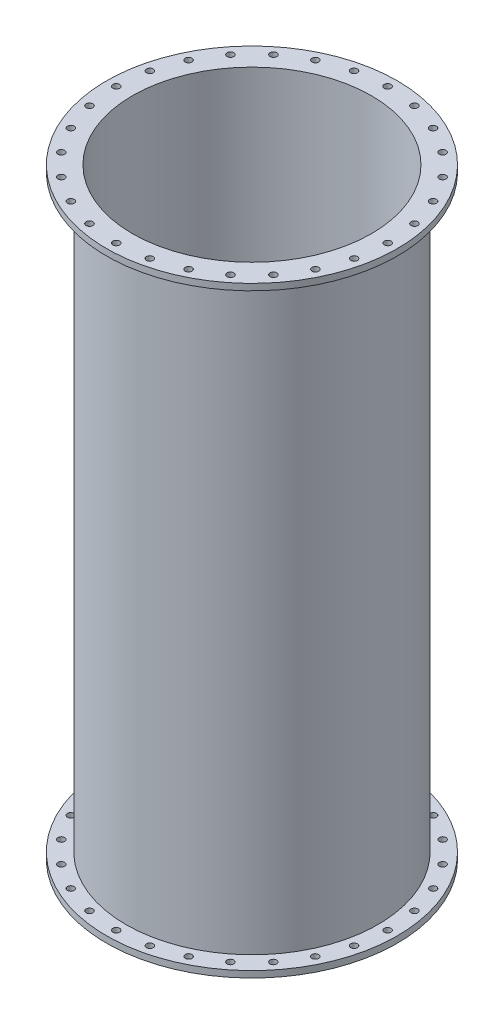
ISO-10303-21;
HEADER;
FILE_DESCRIPTION(('STEP AP214'),'2;1');
FILE_NAME('part.step','',(''),(''),'','','');
FILE_SCHEMA(('AUTOMOTIVE_DESIGN { 1 0 10303 214 1 1 1 1 }'));
ENDSEC;
DATA;
#1=APPLICATION_CONTEXT('core data for automotive mechanical design processes');
#2=APPLICATION_PROTOCOL_DEFINITION('international standard','automotive_design',2000,#1);
#3=PRODUCT_CONTEXT('',#1,'mechanical');
#4=PRODUCT('Part','Part','',(#3));
#5=PRODUCT_RELATED_PRODUCT_CATEGORY('part','',(#4));
#6=PRODUCT_DEFINITION_FORMATION('','',#4);
#7=PRODUCT_DEFINITION_CONTEXT('part definition',#1,'design');
#8=PRODUCT_DEFINITION('design','',#6,#7);
#9=PRODUCT_DEFINITION_SHAPE('','',#8);
#10=(LENGTH_UNIT() NAMED_UNIT(*) SI_UNIT(.MILLI.,.METRE.));
#11=(NAMED_UNIT(*) PLANE_ANGLE_UNIT() SI_UNIT($,.RADIAN.));
#12=(NAMED_UNIT(*) SI_UNIT($,.STERADIAN.) SOLID_ANGLE_UNIT());
#13=UNCERTAINTY_MEASURE_WITH_UNIT(LENGTH_MEASURE(1.E-05),#10,'distance_accuracy_value','');
#14=(GEOMETRIC_REPRESENTATION_CONTEXT(3) GLOBAL_UNCERTAINTY_ASSIGNED_CONTEXT((#13)) GLOBAL_UNIT_ASSIGNED_CONTEXT((#10,
#11,#12)) REPRESENTATION_CONTEXT('',''));
#15=CARTESIAN_POINT('',(0.,0.,0.));
#16=DIRECTION('',(0.,0.,1.));
#17=DIRECTION('',(1.,0.,0.));
#18=AXIS2_PLACEMENT_3D('',#15,#16,#17);
#19=CARTESIAN_POINT('',(0.,0.,0.));
#20=DIRECTION('',(0.,-1.,0.));
#21=DIRECTION('',(0.,0.,-1.));
#22=AXIS2_PLACEMENT_3D('',#19,#20,#21);
#23=CYLINDRICAL_SURFACE('',#22,225.);
#24=CARTESIAN_POINT('',(0.,10.,0.));
#25=DIRECTION('',(0.,-1.,0.));
#26=DIRECTION('',(0.,0.,-1.));
#27=AXIS2_PLACEMENT_3D('',#24,#25,#26);
#28=CIRCLE('',#27,225.);
#29=CARTESIAN_POINT('',(0.,10.,-225.));
#30=VERTEX_POINT('',#29);
#31=EDGE_CURVE('E10',#30,#30,#28,.T.);
#32=ORIENTED_EDGE('',*,*,#31,.T.);
#33=EDGE_LOOP('',(#32));
#34=FACE_BOUND('',#33,.T.);
#35=CARTESIAN_POINT('',(0.,0.,0.));
#36=DIRECTION('',(0.,-1.,0.));
#37=DIRECTION('',(0.,0.,-1.));
#38=AXIS2_PLACEMENT_3D('',#35,#36,#37);
#39=CIRCLE('',#38,225.);
#40=CARTESIAN_POINT('',(0.,0.,-225.));
#41=VERTEX_POINT('',#40);
#42=EDGE_CURVE('E61',#41,#41,#39,.T.);
#43=ORIENTED_EDGE('',*,*,#42,.F.);
#44=EDGE_LOOP('',(#43));
#45=FACE_BOUND('',#44,.T.);
#46=ADVANCED_FACE('F33',(#34,#45),#23,.T.);
#47=CARTESIAN_POINT('',(225.,10.,0.));
#48=DIRECTION('',(0.,1.,0.));
#49=DIRECTION('',(0.,0.,1.));
#50=AXIS2_PLACEMENT_3D('',#47,#48,#49);
#51=PLANE('',#50);
#52=CARTESIAN_POINT('',(-46.7293961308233,10.,-204.734861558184));
#53=DIRECTION('',(0.,1.,0.));
#54=DIRECTION('',(0.,0.,1.));
#55=AXIS2_PLACEMENT_3D('',#52,#53,#54);
#56=CIRCLE('',#55,5.25);
#57=CARTESIAN_POINT('',(-46.7293961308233,10.,-199.484861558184));
#58=VERTEX_POINT('',#57);
#59=EDGE_CURVE('E386',#58,#58,#56,.T.);
#60=ORIENTED_EDGE('',*,*,#59,.F.);
#61=EDGE_LOOP('',(#60));
#62=FACE_BOUND('',#61,.T.);
#63=CARTESIAN_POINT('',(-91.1155852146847,10.,-189.203462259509));
#64=DIRECTION('',(0.,1.,0.));
#65=DIRECTION('',(0.,0.,1.));
#66=AXIS2_PLACEMENT_3D('',#63,#64,#65);
#67=CIRCLE('',#66,5.25);
#68=CARTESIAN_POINT('',(-91.1155852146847,10.,-183.953462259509));
#69=VERTEX_POINT('',#68);
#70=EDGE_CURVE('E374',#69,#69,#67,.T.);
#71=ORIENTED_EDGE('',*,*,#70,.F.);
#72=EDGE_LOOP('',(#71));
#73=FACE_BOUND('',#72,.T.);
#74=CARTESIAN_POINT('',(-130.932858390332,10.,-164.184611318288));
#75=DIRECTION('',(0.,1.,0.));
#76=DIRECTION('',(0.,0.,1.));
#77=AXIS2_PLACEMENT_3D('',#74,#75,#76);
#78=CIRCLE('',#77,5.25);
#79=CARTESIAN_POINT('',(-130.932858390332,10.,-158.934611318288));
#80=VERTEX_POINT('',#79);
#81=EDGE_CURVE('E362',#80,#80,#78,.T.);
#82=ORIENTED_EDGE('',*,*,#81,.F.);
#83=EDGE_LOOP('',(#82));
#84=FACE_BOUND('',#83,.T.);
#85=CARTESIAN_POINT('',(-164.184611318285,10.,-130.932858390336));
#86=DIRECTION('',(0.,1.,0.));
#87=DIRECTION('',(0.,0.,1.));
#88=AXIS2_PLACEMENT_3D('',#85,#86,#87);
#89=CIRCLE('',#88,5.25);
#90=CARTESIAN_POINT('',(-164.184611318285,10.,-125.682858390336));
#91=VERTEX_POINT('',#90);
#92=EDGE_CURVE('E350',#91,#91,#89,.T.);
#93=ORIENTED_EDGE('',*,*,#92,.F.);
#94=EDGE_LOOP('',(#93));
#95=FACE_BOUND('',#94,.T.);
#96=CARTESIAN_POINT('',(-189.203462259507,10.,-91.1155852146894));
#97=DIRECTION('',(0.,1.,0.));
#98=DIRECTION('',(0.,0.,1.));
#99=AXIS2_PLACEMENT_3D('',#96,#97,#98);
#100=CIRCLE('',#99,5.25);
#101=CARTESIAN_POINT('',(-189.203462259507,10.,-85.8655852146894));
#102=VERTEX_POINT('',#101);
#103=EDGE_CURVE('E338',#102,#102,#100,.T.);
#104=ORIENTED_EDGE('',*,*,#103,.F.);
#105=EDGE_LOOP('',(#104));
#106=FACE_BOUND('',#105,.T.);
#107=CARTESIAN_POINT('',(-204.734861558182,10.,-46.7293961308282));
#108=DIRECTION('',(0.,1.,0.));
#109=DIRECTION('',(0.,0.,1.));
#110=AXIS2_PLACEMENT_3D('',#107,#108,#109);
#111=CIRCLE('',#110,5.25);
#112=CARTESIAN_POINT('',(-204.734861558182,10.,-41.4793961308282));
#113=VERTEX_POINT('',#112);
#114=EDGE_CURVE('E326',#113,#113,#111,.T.);
#115=ORIENTED_EDGE('',*,*,#114,.F.);
#116=EDGE_LOOP('',(#115));
#117=FACE_BOUND('',#116,.T.);
#118=CARTESIAN_POINT('',(-210.,10.,-2.19963324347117E-12));
#119=DIRECTION('',(0.,1.,0.));
#120=DIRECTION('',(0.,0.,1.));
#121=AXIS2_PLACEMENT_3D('',#118,#119,#120);
#122=CIRCLE('',#121,5.25);
#123=CARTESIAN_POINT('',(-210.,10.,5.2499999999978));
#124=VERTEX_POINT('',#123);
#125=EDGE_CURVE('E314',#124,#124,#122,.T.);
#126=ORIENTED_EDGE('',*,*,#125,.F.);
#127=EDGE_LOOP('',(#126));
#128=FACE_BOUND('',#127,.T.);
#129=CARTESIAN_POINT('',(-204.734861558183,10.,46.7293961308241));
#130=DIRECTION('',(0.,1.,0.));
#131=DIRECTION('',(0.,0.,1.));
#132=AXIS2_PLACEMENT_3D('',#129,#130,#131);
#133=CIRCLE('',#132,5.25);
#134=CARTESIAN_POINT('',(-204.734861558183,10.,51.9793961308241));
#135=VERTEX_POINT('',#134);
#136=EDGE_CURVE('E302',#135,#135,#133,.T.);
#137=ORIENTED_EDGE('',*,*,#136,.F.);
#138=EDGE_LOOP('',(#137));
#139=FACE_BOUND('',#138,.T.);
#140=CARTESIAN_POINT('',(-189.203462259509,10.,91.1155852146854));
#141=DIRECTION('',(0.,1.,0.));
#142=DIRECTION('',(0.,0.,1.));
#143=AXIS2_PLACEMENT_3D('',#140,#141,#142);
#144=CIRCLE('',#143,5.25);
#145=CARTESIAN_POINT('',(-189.203462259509,10.,96.3655852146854));
#146=VERTEX_POINT('',#145);
#147=EDGE_CURVE('E290',#146,#146,#144,.T.);
#148=ORIENTED_EDGE('',*,*,#147,.F.);
#149=EDGE_LOOP('',(#148));
#150=FACE_BOUND('',#149,.T.);
#151=CARTESIAN_POINT('',(-164.184611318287,10.,130.932858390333));
#152=DIRECTION('',(0.,1.,0.));
#153=DIRECTION('',(0.,0.,1.));
#154=AXIS2_PLACEMENT_3D('',#151,#152,#153);
#155=CIRCLE('',#154,5.25);
#156=CARTESIAN_POINT('',(-164.184611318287,10.,136.182858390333));
#157=VERTEX_POINT('',#156);
#158=EDGE_CURVE('E278',#157,#157,#155,.T.);
#159=ORIENTED_EDGE('',*,*,#158,.F.);
#160=EDGE_LOOP('',(#159));
#161=FACE_BOUND('',#160,.T.);
#162=CARTESIAN_POINT('',(-130.932858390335,10.,164.184611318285));
#163=DIRECTION('',(0.,1.,0.));
#164=DIRECTION('',(0.,0.,1.));
#165=AXIS2_PLACEMENT_3D('',#162,#163,#164);
#166=CIRCLE('',#165,5.25);
#167=CARTESIAN_POINT('',(-130.932858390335,10.,169.434611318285));
#168=VERTEX_POINT('',#167);
#169=EDGE_CURVE('E266',#168,#168,#166,.T.);
#170=ORIENTED_EDGE('',*,*,#169,.F.);
#171=EDGE_LOOP('',(#170));
#172=FACE_BOUND('',#171,.T.);
#173=CARTESIAN_POINT('',(-91.1155852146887,10.,189.203462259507));
#174=DIRECTION('',(0.,1.,0.));
#175=DIRECTION('',(0.,0.,1.));
#176=AXIS2_PLACEMENT_3D('',#173,#174,#175);
#177=CIRCLE('',#176,5.25);
#178=CARTESIAN_POINT('',(-91.1155852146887,10.,194.453462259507));
#179=VERTEX_POINT('',#178);
#180=EDGE_CURVE('E254',#179,#179,#177,.T.);
#181=ORIENTED_EDGE('',*,*,#180,.F.);
#182=EDGE_LOOP('',(#181));
#183=FACE_BOUND('',#182,.T.);
#184=CARTESIAN_POINT('',(-46.7293961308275,10.,204.734861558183));
#185=DIRECTION('',(0.,1.,0.));
#186=DIRECTION('',(0.,0.,1.));
#187=AXIS2_PLACEMENT_3D('',#184,#185,#186);
#188=CIRCLE('',#187,5.25);
#189=CARTESIAN_POINT('',(-46.7293961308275,10.,209.984861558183));
#190=VERTEX_POINT('',#189);
#191=EDGE_CURVE('E242',#190,#190,#188,.T.);
#192=ORIENTED_EDGE('',*,*,#191,.F.);
#193=EDGE_LOOP('',(#192));
#194=FACE_BOUND('',#193,.T.);
#195=CARTESIAN_POINT('',(0.,10.,210.));
#196=DIRECTION('',(0.,1.,0.));
#197=DIRECTION('',(0.,0.,1.));
#198=AXIS2_PLACEMENT_3D('',#195,#196,#197);
#199=CIRCLE('',#198,5.25);
#200=CARTESIAN_POINT('',(0.,10.,215.25));
#201=VERTEX_POINT('',#200);
#202=EDGE_CURVE('E230',#201,#201,#199,.T.);
#203=ORIENTED_EDGE('',*,*,#202,.F.);
#204=EDGE_LOOP('',(#203));
#205=FACE_BOUND('',#204,.T.);
#206=CARTESIAN_POINT('',(46.7293961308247,10.,204.734861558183));
#207=DIRECTION('',(0.,1.,0.));
#208=DIRECTION('',(0.,0.,1.));
#209=AXIS2_PLACEMENT_3D('',#206,#207,#208);
#210=CIRCLE('',#209,5.25);
#211=CARTESIAN_POINT('',(46.7293961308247,10.,209.984861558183));
#212=VERTEX_POINT('',#211);
#213=EDGE_CURVE('E218',#212,#212,#210,.T.);
#214=ORIENTED_EDGE('',*,*,#213,.F.);
#215=EDGE_LOOP('',(#214));
#216=FACE_BOUND('',#215,.T.);
#217=CARTESIAN_POINT('',(91.115585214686,10.,189.203462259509));
#218=DIRECTION('',(0.,1.,0.));
#219=DIRECTION('',(0.,0.,1.));
#220=AXIS2_PLACEMENT_3D('',#217,#218,#219);
#221=CIRCLE('',#220,5.25);
#222=CARTESIAN_POINT('',(91.115585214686,10.,194.453462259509));
#223=VERTEX_POINT('',#222);
#224=EDGE_CURVE('E206',#223,#223,#221,.T.);
#225=ORIENTED_EDGE('',*,*,#224,.F.);
#226=EDGE_LOOP('',(#225));
#227=FACE_BOUND('',#226,.T.);
#228=CARTESIAN_POINT('',(130.932858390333,10.,164.184611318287));
#229=DIRECTION('',(0.,1.,0.));
#230=DIRECTION('',(0.,0.,1.));
#231=AXIS2_PLACEMENT_3D('',#228,#229,#230);
#232=CIRCLE('',#231,5.25);
#233=CARTESIAN_POINT('',(130.932858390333,10.,169.434611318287));
#234=VERTEX_POINT('',#233);
#235=EDGE_CURVE('E194',#234,#234,#232,.T.);
#236=ORIENTED_EDGE('',*,*,#235,.F.);
#237=EDGE_LOOP('',(#236));
#238=FACE_BOUND('',#237,.T.);
#239=CARTESIAN_POINT('',(164.184611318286,10.,130.932858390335));
#240=DIRECTION('',(0.,1.,0.));
#241=DIRECTION('',(0.,0.,1.));
#242=AXIS2_PLACEMENT_3D('',#239,#240,#241);
#243=CIRCLE('',#242,5.25);
#244=CARTESIAN_POINT('',(164.184611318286,10.,136.182858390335));
#245=VERTEX_POINT('',#244);
#246=EDGE_CURVE('E182',#245,#245,#243,.T.);
#247=ORIENTED_EDGE('',*,*,#246,.F.);
#248=EDGE_LOOP('',(#247));
#249=FACE_BOUND('',#248,.T.);
#250=CARTESIAN_POINT('',(189.203462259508,10.,91.115585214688));
#251=DIRECTION('',(0.,1.,0.));
#252=DIRECTION('',(0.,0.,1.));
#253=AXIS2_PLACEMENT_3D('',#250,#251,#252);
#254=CIRCLE('',#253,5.25);
#255=CARTESIAN_POINT('',(189.203462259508,10.,96.365585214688));
#256=VERTEX_POINT('',#255);
#257=EDGE_CURVE('E170',#256,#256,#254,.T.);
#258=ORIENTED_EDGE('',*,*,#257,.F.);
#259=EDGE_LOOP('',(#258));
#260=FACE_BOUND('',#259,.T.);
#261=CARTESIAN_POINT('',(204.734861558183,10.,46.7293961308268));
#262=DIRECTION('',(0.,1.,0.));
#263=DIRECTION('',(0.,0.,1.));
#264=AXIS2_PLACEMENT_3D('',#261,#262,#263);
#265=CIRCLE('',#264,5.25);
#266=CARTESIAN_POINT('',(204.734861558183,10.,51.9793961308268));
#267=VERTEX_POINT('',#266);
#268=EDGE_CURVE('E158',#267,#267,#265,.T.);
#269=ORIENTED_EDGE('',*,*,#268,.F.);
#270=EDGE_LOOP('',(#269));
#271=FACE_BOUND('',#270,.T.);
#272=CARTESIAN_POINT('',(210.,10.,7.33211081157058E-13));
#273=DIRECTION('',(0.,1.,0.));
#274=DIRECTION('',(0.,0.,1.));
#275=AXIS2_PLACEMENT_3D('',#272,#273,#274);
#276=CIRCLE('',#275,5.25);
#277=CARTESIAN_POINT('',(210.,10.,5.25000000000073));
#278=VERTEX_POINT('',#277);
#279=EDGE_CURVE('E146',#278,#278,#276,.T.);
#280=ORIENTED_EDGE('',*,*,#279,.F.);
#281=EDGE_LOOP('',(#280));
#282=FACE_BOUND('',#281,.T.);
#283=CARTESIAN_POINT('',(204.734861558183,10.,-46.7293961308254));
#284=DIRECTION('',(0.,1.,0.));
#285=DIRECTION('',(0.,0.,1.));
#286=AXIS2_PLACEMENT_3D('',#283,#284,#285);
#287=CIRCLE('',#286,5.25);
#288=CARTESIAN_POINT('',(204.734861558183,10.,-41.4793961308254));
#289=VERTEX_POINT('',#288);
#290=EDGE_CURVE('E134',#289,#289,#287,.T.);
#291=ORIENTED_EDGE('',*,*,#290,.F.);
#292=EDGE_LOOP('',(#291));
#293=FACE_BOUND('',#292,.T.);
#294=CARTESIAN_POINT('',(189.203462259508,10.,-91.1155852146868));
#295=DIRECTION('',(0.,1.,0.));
#296=DIRECTION('',(0.,0.,1.));
#297=AXIS2_PLACEMENT_3D('',#294,#295,#296);
#298=CIRCLE('',#297,5.25);
#299=CARTESIAN_POINT('',(189.203462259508,10.,-85.8655852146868));
#300=VERTEX_POINT('',#299);
#301=EDGE_CURVE('E122',#300,#300,#298,.T.);
#302=ORIENTED_EDGE('',*,*,#301,.F.);
#303=EDGE_LOOP('',(#302));
#304=FACE_BOUND('',#303,.T.);
#305=CARTESIAN_POINT('',(164.184611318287,10.,-130.932858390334));
#306=DIRECTION('',(0.,1.,0.));
#307=DIRECTION('',(0.,0.,1.));
#308=AXIS2_PLACEMENT_3D('',#305,#306,#307);
#309=CIRCLE('',#308,5.25);
#310=CARTESIAN_POINT('',(164.184611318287,10.,-125.682858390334));
#311=VERTEX_POINT('',#310);
#312=EDGE_CURVE('E110',#311,#311,#309,.T.);
#313=ORIENTED_EDGE('',*,*,#312,.F.);
#314=EDGE_LOOP('',(#313));
#315=FACE_BOUND('',#314,.T.);
#316=CARTESIAN_POINT('',(130.932858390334,10.,-164.184611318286));
#317=DIRECTION('',(0.,1.,0.));
#318=DIRECTION('',(0.,0.,1.));
#319=AXIS2_PLACEMENT_3D('',#316,#317,#318);
#320=CIRCLE('',#319,5.25);
#321=CARTESIAN_POINT('',(130.932858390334,10.,-158.934611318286));
#322=VERTEX_POINT('',#321);
#323=EDGE_CURVE('E98',#322,#322,#320,.T.);
#324=ORIENTED_EDGE('',*,*,#323,.F.);
#325=EDGE_LOOP('',(#324));
#326=FACE_BOUND('',#325,.T.);
#327=CARTESIAN_POINT('',(91.1155852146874,10.,-189.203462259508));
#328=DIRECTION('',(0.,1.,0.));
#329=DIRECTION('',(0.,0.,1.));
#330=AXIS2_PLACEMENT_3D('',#327,#328,#329);
#331=CIRCLE('',#330,5.25);
#332=CARTESIAN_POINT('',(91.1155852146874,10.,-183.953462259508));
#333=VERTEX_POINT('',#332);
#334=EDGE_CURVE('E86',#333,#333,#331,.T.);
#335=ORIENTED_EDGE('',*,*,#334,.F.);
#336=EDGE_LOOP('',(#335));
#337=FACE_BOUND('',#336,.T.);
#338=CARTESIAN_POINT('',(46.7293961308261,10.,-204.734861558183));
#339=DIRECTION('',(0.,1.,0.));
#340=DIRECTION('',(0.,0.,1.));
#341=AXIS2_PLACEMENT_3D('',#338,#339,#340);
#342=CIRCLE('',#341,5.25);
#343=CARTESIAN_POINT('',(46.7293961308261,10.,-199.484861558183));
#344=VERTEX_POINT('',#343);
#345=EDGE_CURVE('E74',#344,#344,#342,.T.);
#346=ORIENTED_EDGE('',*,*,#345,.F.);
#347=EDGE_LOOP('',(#346));
#348=FACE_BOUND('',#347,.T.);
#349=CARTESIAN_POINT('',(0.,10.,-210.));
#350=DIRECTION('',(0.,1.,0.));
#351=DIRECTION('',(0.,0.,1.));
#352=AXIS2_PLACEMENT_3D('',#349,#350,#351);
#353=CIRCLE('',#352,5.25);
#354=CARTESIAN_POINT('',(0.,10.,-204.75));
#355=VERTEX_POINT('',#354);
#356=EDGE_CURVE('E64',#355,#355,#353,.T.);
#357=ORIENTED_EDGE('',*,*,#356,.F.);
#358=EDGE_LOOP('',(#357));
#359=FACE_BOUND('',#358,.T.);
#360=CARTESIAN_POINT('',(0.,10.,0.));
#361=DIRECTION('',(0.,-1.,0.));
#362=DIRECTION('',(0.,0.,-1.));
#363=AXIS2_PLACEMENT_3D('',#360,#361,#362);
#364=CIRCLE('',#363,195.);
#365=CARTESIAN_POINT('',(0.,10.,-195.));
#366=VERTEX_POINT('',#365);
#367=EDGE_CURVE('E39',#366,#366,#364,.T.);
#368=ORIENTED_EDGE('',*,*,#367,.T.);
#369=EDGE_LOOP('',(#368));
#370=FACE_BOUND('',#369,.T.);
#371=ORIENTED_EDGE('',*,*,#31,.F.);
#372=EDGE_LOOP('',(#371));
#373=FACE_BOUND('',#372,.T.);
#374=ADVANCED_FACE('F419',(#62,#73,#84,#95,#106,#117,#128,#139,#150,#161,#172,#183,#194,#205,
#216,#227,#238,#249,#260,#271,#282,#293,#304,#315,#326,#337,#348,#359,#370,#373),#51,.T.);
#375=CARTESIAN_POINT('',(0.,0.,0.));
#376=DIRECTION('',(0.,-1.,0.));
#377=DIRECTION('',(0.,0.,-1.));
#378=AXIS2_PLACEMENT_3D('',#375,#376,#377);
#379=CYLINDRICAL_SURFACE('',#378,195.);
#380=CARTESIAN_POINT('',(0.,921.1,0.));
#381=DIRECTION('',(0.,-1.,0.));
#382=DIRECTION('',(0.,0.,-1.));
#383=AXIS2_PLACEMENT_3D('',#380,#381,#382);
#384=CIRCLE('',#383,195.);
#385=CARTESIAN_POINT('',(0.,921.1,-195.));
#386=VERTEX_POINT('',#385);
#387=EDGE_CURVE('E43',#386,#386,#384,.T.);
#388=ORIENTED_EDGE('',*,*,#387,.T.);
#389=EDGE_LOOP('',(#388));
#390=FACE_BOUND('',#389,.T.);
#391=ORIENTED_EDGE('',*,*,#367,.F.);
#392=EDGE_LOOP('',(#391));
#393=FACE_BOUND('',#392,.T.);
#394=ADVANCED_FACE('F423',(#390,#393),#379,.T.);
#395=CARTESIAN_POINT('',(195.,921.1,0.));
#396=DIRECTION('',(0.,-1.,0.));
#397=DIRECTION('',(0.,0.,-1.));
#398=AXIS2_PLACEMENT_3D('',#395,#396,#397);
#399=PLANE('',#398);
#400=CARTESIAN_POINT('',(-46.7293961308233,921.1,-204.734861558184));
#401=DIRECTION('',(0.,-1.,0.));
#402=DIRECTION('',(0.,0.,-1.));
#403=AXIS2_PLACEMENT_3D('',#400,#401,#402);
#404=CIRCLE('',#403,5.25);
#405=CARTESIAN_POINT('',(-46.7293961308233,921.1,-209.984861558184));
#406=VERTEX_POINT('',#405);
#407=EDGE_CURVE('E391',#406,#406,#404,.T.);
#408=ORIENTED_EDGE('',*,*,#407,.F.);
#409=EDGE_LOOP('',(#408));
#410=FACE_BOUND('',#409,.T.);
#411=CARTESIAN_POINT('',(-91.1155852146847,921.1,-189.203462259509));
#412=DIRECTION('',(0.,-1.,0.));
#413=DIRECTION('',(0.,0.,-1.));
#414=AXIS2_PLACEMENT_3D('',#411,#412,#413);
#415=CIRCLE('',#414,5.25);
#416=CARTESIAN_POINT('',(-91.1155852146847,921.1,-194.453462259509));
#417=VERTEX_POINT('',#416);
#418=EDGE_CURVE('E379',#417,#417,#415,.T.);
#419=ORIENTED_EDGE('',*,*,#418,.F.);
#420=EDGE_LOOP('',(#419));
#421=FACE_BOUND('',#420,.T.);
#422=CARTESIAN_POINT('',(-130.932858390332,921.1,-164.184611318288));
#423=DIRECTION('',(0.,-1.,0.));
#424=DIRECTION('',(0.,0.,-1.));
#425=AXIS2_PLACEMENT_3D('',#422,#423,#424);
#426=CIRCLE('',#425,5.25);
#427=CARTESIAN_POINT('',(-130.932858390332,921.1,-169.434611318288));
#428=VERTEX_POINT('',#427);
#429=EDGE_CURVE('E367',#428,#428,#426,.T.);
#430=ORIENTED_EDGE('',*,*,#429,.F.);
#431=EDGE_LOOP('',(#430));
#432=FACE_BOUND('',#431,.T.);
#433=CARTESIAN_POINT('',(-164.184611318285,921.1,-130.932858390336));
#434=DIRECTION('',(0.,-1.,0.));
#435=DIRECTION('',(0.,0.,-1.));
#436=AXIS2_PLACEMENT_3D('',#433,#434,#435);
#437=CIRCLE('',#436,5.25);
#438=CARTESIAN_POINT('',(-164.184611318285,921.1,-136.182858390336));
#439=VERTEX_POINT('',#438);
#440=EDGE_CURVE('E355',#439,#439,#437,.T.);
#441=ORIENTED_EDGE('',*,*,#440,.F.);
#442=EDGE_LOOP('',(#441));
#443=FACE_BOUND('',#442,.T.);
#444=CARTESIAN_POINT('',(-189.203462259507,921.1,-91.1155852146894));
#445=DIRECTION('',(0.,-1.,0.));
#446=DIRECTION('',(0.,0.,-1.));
#447=AXIS2_PLACEMENT_3D('',#444,#445,#446);
#448=CIRCLE('',#447,5.25);
#449=CARTESIAN_POINT('',(-189.203462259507,921.1,-96.3655852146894));
#450=VERTEX_POINT('',#449);
#451=EDGE_CURVE('E343',#450,#450,#448,.T.);
#452=ORIENTED_EDGE('',*,*,#451,.F.);
#453=EDGE_LOOP('',(#452));
#454=FACE_BOUND('',#453,.T.);
#455=CARTESIAN_POINT('',(-204.734861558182,921.1,-46.7293961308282));
#456=DIRECTION('',(0.,-1.,0.));
#457=DIRECTION('',(0.,0.,-1.));
#458=AXIS2_PLACEMENT_3D('',#455,#456,#457);
#459=CIRCLE('',#458,5.25);
#460=CARTESIAN_POINT('',(-204.734861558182,921.1,-51.9793961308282));
#461=VERTEX_POINT('',#460);
#462=EDGE_CURVE('E331',#461,#461,#459,.T.);
#463=ORIENTED_EDGE('',*,*,#462,.F.);
#464=EDGE_LOOP('',(#463));
#465=FACE_BOUND('',#464,.T.);
#466=CARTESIAN_POINT('',(-210.,921.1,-2.19963324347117E-12));
#467=DIRECTION('',(0.,-1.,0.));
#468=DIRECTION('',(0.,0.,-1.));
#469=AXIS2_PLACEMENT_3D('',#466,#467,#468);
#470=CIRCLE('',#469,5.25);
#471=CARTESIAN_POINT('',(-210.,921.1,-5.2500000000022));
#472=VERTEX_POINT('',#471);
#473=EDGE_CURVE('E319',#472,#472,#470,.T.);
#474=ORIENTED_EDGE('',*,*,#473,.F.);
#475=EDGE_LOOP('',(#474));
#476=FACE_BOUND('',#475,.T.);
#477=CARTESIAN_POINT('',(-204.734861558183,921.1,46.7293961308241));
#478=DIRECTION('',(0.,-1.,0.));
#479=DIRECTION('',(0.,0.,-1.));
#480=AXIS2_PLACEMENT_3D('',#477,#478,#479);
#481=CIRCLE('',#480,5.25);
#482=CARTESIAN_POINT('',(-204.734861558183,921.1,41.4793961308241));
#483=VERTEX_POINT('',#482);
#484=EDGE_CURVE('E307',#483,#483,#481,.T.);
#485=ORIENTED_EDGE('',*,*,#484,.F.);
#486=EDGE_LOOP('',(#485));
#487=FACE_BOUND('',#486,.T.);
#488=CARTESIAN_POINT('',(-189.203462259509,921.1,91.1155852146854));
#489=DIRECTION('',(0.,-1.,0.));
#490=DIRECTION('',(0.,0.,-1.));
#491=AXIS2_PLACEMENT_3D('',#488,#489,#490);
#492=CIRCLE('',#491,5.25);
#493=CARTESIAN_POINT('',(-189.203462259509,921.1,85.8655852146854));
#494=VERTEX_POINT('',#493);
#495=EDGE_CURVE('E295',#494,#494,#492,.T.);
#496=ORIENTED_EDGE('',*,*,#495,.F.);
#497=EDGE_LOOP('',(#496));
#498=FACE_BOUND('',#497,.T.);
#499=CARTESIAN_POINT('',(-164.184611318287,921.1,130.932858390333));
#500=DIRECTION('',(0.,-1.,0.));
#501=DIRECTION('',(0.,0.,-1.));
#502=AXIS2_PLACEMENT_3D('',#499,#500,#501);
#503=CIRCLE('',#502,5.25);
#504=CARTESIAN_POINT('',(-164.184611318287,921.1,125.682858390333));
#505=VERTEX_POINT('',#504);
#506=EDGE_CURVE('E283',#505,#505,#503,.T.);
#507=ORIENTED_EDGE('',*,*,#506,.F.);
#508=EDGE_LOOP('',(#507));
#509=FACE_BOUND('',#508,.T.);
#510=CARTESIAN_POINT('',(-130.932858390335,921.1,164.184611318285));
#511=DIRECTION('',(0.,-1.,0.));
#512=DIRECTION('',(0.,0.,-1.));
#513=AXIS2_PLACEMENT_3D('',#510,#511,#512);
#514=CIRCLE('',#513,5.25);
#515=CARTESIAN_POINT('',(-130.932858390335,921.1,158.934611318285));
#516=VERTEX_POINT('',#515);
#517=EDGE_CURVE('E271',#516,#516,#514,.T.);
#518=ORIENTED_EDGE('',*,*,#517,.F.);
#519=EDGE_LOOP('',(#518));
#520=FACE_BOUND('',#519,.T.);
#521=CARTESIAN_POINT('',(-91.1155852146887,921.1,189.203462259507));
#522=DIRECTION('',(0.,-1.,0.));
#523=DIRECTION('',(0.,0.,-1.));
#524=AXIS2_PLACEMENT_3D('',#521,#522,#523);
#525=CIRCLE('',#524,5.25);
#526=CARTESIAN_POINT('',(-91.1155852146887,921.1,183.953462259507));
#527=VERTEX_POINT('',#526);
#528=EDGE_CURVE('E259',#527,#527,#525,.T.);
#529=ORIENTED_EDGE('',*,*,#528,.F.);
#530=EDGE_LOOP('',(#529));
#531=FACE_BOUND('',#530,.T.);
#532=CARTESIAN_POINT('',(-46.7293961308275,921.1,204.734861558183));
#533=DIRECTION('',(0.,-1.,0.));
#534=DIRECTION('',(0.,0.,-1.));
#535=AXIS2_PLACEMENT_3D('',#532,#533,#534);
#536=CIRCLE('',#535,5.25);
#537=CARTESIAN_POINT('',(-46.7293961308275,921.1,199.484861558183));
#538=VERTEX_POINT('',#537);
#539=EDGE_CURVE('E247',#538,#538,#536,.T.);
#540=ORIENTED_EDGE('',*,*,#539,.F.);
#541=EDGE_LOOP('',(#540));
#542=FACE_BOUND('',#541,.T.);
#543=CARTESIAN_POINT('',(0.,921.1,210.));
#544=DIRECTION('',(0.,-1.,0.));
#545=DIRECTION('',(0.,0.,-1.));
#546=AXIS2_PLACEMENT_3D('',#543,#544,#545);
#547=CIRCLE('',#546,5.25);
#548=CARTESIAN_POINT('',(0.,921.1,204.75));
#549=VERTEX_POINT('',#548);
#550=EDGE_CURVE('E235',#549,#549,#547,.T.);
#551=ORIENTED_EDGE('',*,*,#550,.F.);
#552=EDGE_LOOP('',(#551));
#553=FACE_BOUND('',#552,.T.);
#554=CARTESIAN_POINT('',(46.7293961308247,921.1,204.734861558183));
#555=DIRECTION('',(0.,-1.,0.));
#556=DIRECTION('',(0.,0.,-1.));
#557=AXIS2_PLACEMENT_3D('',#554,#555,#556);
#558=CIRCLE('',#557,5.25);
#559=CARTESIAN_POINT('',(46.7293961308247,921.1,199.484861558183));
#560=VERTEX_POINT('',#559);
#561=EDGE_CURVE('E223',#560,#560,#558,.T.);
#562=ORIENTED_EDGE('',*,*,#561,.F.);
#563=EDGE_LOOP('',(#562));
#564=FACE_BOUND('',#563,.T.);
#565=CARTESIAN_POINT('',(91.115585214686,921.1,189.203462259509));
#566=DIRECTION('',(0.,-1.,0.));
#567=DIRECTION('',(0.,0.,-1.));
#568=AXIS2_PLACEMENT_3D('',#565,#566,#567);
#569=CIRCLE('',#568,5.25);
#570=CARTESIAN_POINT('',(91.115585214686,921.1,183.953462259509));
#571=VERTEX_POINT('',#570);
#572=EDGE_CURVE('E211',#571,#571,#569,.T.);
#573=ORIENTED_EDGE('',*,*,#572,.F.);
#574=EDGE_LOOP('',(#573));
#575=FACE_BOUND('',#574,.T.);
#576=CARTESIAN_POINT('',(130.932858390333,921.1,164.184611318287));
#577=DIRECTION('',(0.,-1.,0.));
#578=DIRECTION('',(0.,0.,-1.));
#579=AXIS2_PLACEMENT_3D('',#576,#577,#578);
#580=CIRCLE('',#579,5.25);
#581=CARTESIAN_POINT('',(130.932858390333,921.1,158.934611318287));
#582=VERTEX_POINT('',#581);
#583=EDGE_CURVE('E199',#582,#582,#580,.T.);
#584=ORIENTED_EDGE('',*,*,#583,.F.);
#585=EDGE_LOOP('',(#584));
#586=FACE_BOUND('',#585,.T.);
#587=CARTESIAN_POINT('',(164.184611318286,921.1,130.932858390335));
#588=DIRECTION('',(0.,-1.,0.));
#589=DIRECTION('',(0.,0.,-1.));
#590=AXIS2_PLACEMENT_3D('',#587,#588,#589);
#591=CIRCLE('',#590,5.25);
#592=CARTESIAN_POINT('',(164.184611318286,921.1,125.682858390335));
#593=VERTEX_POINT('',#592);
#594=EDGE_CURVE('E187',#593,#593,#591,.T.);
#595=ORIENTED_EDGE('',*,*,#594,.F.);
#596=EDGE_LOOP('',(#595));
#597=FACE_BOUND('',#596,.T.);
#598=CARTESIAN_POINT('',(189.203462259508,921.1,91.115585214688));
#599=DIRECTION('',(0.,-1.,0.));
#600=DIRECTION('',(0.,0.,-1.));
#601=AXIS2_PLACEMENT_3D('',#598,#599,#600);
#602=CIRCLE('',#601,5.25);
#603=CARTESIAN_POINT('',(189.203462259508,921.1,85.865585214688));
#604=VERTEX_POINT('',#603);
#605=EDGE_CURVE('E175',#604,#604,#602,.T.);
#606=ORIENTED_EDGE('',*,*,#605,.F.);
#607=EDGE_LOOP('',(#606));
#608=FACE_BOUND('',#607,.T.);
#609=CARTESIAN_POINT('',(204.734861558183,921.1,46.7293961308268));
#610=DIRECTION('',(0.,-1.,0.));
#611=DIRECTION('',(0.,0.,-1.));
#612=AXIS2_PLACEMENT_3D('',#609,#610,#611);
#613=CIRCLE('',#612,5.25);
#614=CARTESIAN_POINT('',(204.734861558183,921.1,41.4793961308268));
#615=VERTEX_POINT('',#614);
#616=EDGE_CURVE('E163',#615,#615,#613,.T.);
#617=ORIENTED_EDGE('',*,*,#616,.F.);
#618=EDGE_LOOP('',(#617));
#619=FACE_BOUND('',#618,.T.);
#620=CARTESIAN_POINT('',(210.,921.1,7.33211081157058E-13));
#621=DIRECTION('',(0.,-1.,0.));
#622=DIRECTION('',(0.,0.,-1.));
#623=AXIS2_PLACEMENT_3D('',#620,#621,#622);
#624=CIRCLE('',#623,5.25);
#625=CARTESIAN_POINT('',(210.,921.1,-5.24999999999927));
#626=VERTEX_POINT('',#625);
#627=EDGE_CURVE('E151',#626,#626,#624,.T.);
#628=ORIENTED_EDGE('',*,*,#627,.F.);
#629=EDGE_LOOP('',(#628));
#630=FACE_BOUND('',#629,.T.);
#631=CARTESIAN_POINT('',(204.734861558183,921.1,-46.7293961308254));
#632=DIRECTION('',(0.,-1.,0.));
#633=DIRECTION('',(0.,0.,-1.));
#634=AXIS2_PLACEMENT_3D('',#631,#632,#633);
#635=CIRCLE('',#634,5.25);
#636=CARTESIAN_POINT('',(204.734861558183,921.1,-51.9793961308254));
#637=VERTEX_POINT('',#636);
#638=EDGE_CURVE('E139',#637,#637,#635,.T.);
#639=ORIENTED_EDGE('',*,*,#638,.F.);
#640=EDGE_LOOP('',(#639));
#641=FACE_BOUND('',#640,.T.);
#642=CARTESIAN_POINT('',(189.203462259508,921.1,-91.1155852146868));
#643=DIRECTION('',(0.,-1.,0.));
#644=DIRECTION('',(0.,0.,-1.));
#645=AXIS2_PLACEMENT_3D('',#642,#643,#644);
#646=CIRCLE('',#645,5.25);
#647=CARTESIAN_POINT('',(189.203462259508,921.1,-96.3655852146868));
#648=VERTEX_POINT('',#647);
#649=EDGE_CURVE('E127',#648,#648,#646,.T.);
#650=ORIENTED_EDGE('',*,*,#649,.F.);
#651=EDGE_LOOP('',(#650));
#652=FACE_BOUND('',#651,.T.);
#653=CARTESIAN_POINT('',(164.184611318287,921.1,-130.932858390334));
#654=DIRECTION('',(0.,-1.,0.));
#655=DIRECTION('',(0.,0.,-1.));
#656=AXIS2_PLACEMENT_3D('',#653,#654,#655);
#657=CIRCLE('',#656,5.25);
#658=CARTESIAN_POINT('',(164.184611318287,921.1,-136.182858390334));
#659=VERTEX_POINT('',#658);
#660=EDGE_CURVE('E115',#659,#659,#657,.T.);
#661=ORIENTED_EDGE('',*,*,#660,.F.);
#662=EDGE_LOOP('',(#661));
#663=FACE_BOUND('',#662,.T.);
#664=CARTESIAN_POINT('',(130.932858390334,921.1,-164.184611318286));
#665=DIRECTION('',(0.,-1.,0.));
#666=DIRECTION('',(0.,0.,-1.));
#667=AXIS2_PLACEMENT_3D('',#664,#665,#666);
#668=CIRCLE('',#667,5.25);
#669=CARTESIAN_POINT('',(130.932858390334,921.1,-169.434611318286));
#670=VERTEX_POINT('',#669);
#671=EDGE_CURVE('E103',#670,#670,#668,.T.);
#672=ORIENTED_EDGE('',*,*,#671,.F.);
#673=EDGE_LOOP('',(#672));
#674=FACE_BOUND('',#673,.T.);
#675=CARTESIAN_POINT('',(91.1155852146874,921.1,-189.203462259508));
#676=DIRECTION('',(0.,-1.,0.));
#677=DIRECTION('',(0.,0.,-1.));
#678=AXIS2_PLACEMENT_3D('',#675,#676,#677);
#679=CIRCLE('',#678,5.25);
#680=CARTESIAN_POINT('',(91.1155852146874,921.1,-194.453462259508));
#681=VERTEX_POINT('',#680);
#682=EDGE_CURVE('E91',#681,#681,#679,.T.);
#683=ORIENTED_EDGE('',*,*,#682,.F.);
#684=EDGE_LOOP('',(#683));
#685=FACE_BOUND('',#684,.T.);
#686=CARTESIAN_POINT('',(46.7293961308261,921.1,-204.734861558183));
#687=DIRECTION('',(0.,-1.,0.));
#688=DIRECTION('',(0.,0.,-1.));
#689=AXIS2_PLACEMENT_3D('',#686,#687,#688);
#690=CIRCLE('',#689,5.25);
#691=CARTESIAN_POINT('',(46.7293961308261,921.1,-209.984861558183));
#692=VERTEX_POINT('',#691);
#693=EDGE_CURVE('E79',#692,#692,#690,.T.);
#694=ORIENTED_EDGE('',*,*,#693,.F.);
#695=EDGE_LOOP('',(#694));
#696=FACE_BOUND('',#695,.T.);
#697=CARTESIAN_POINT('',(0.,921.1,-210.));
#698=DIRECTION('',(0.,-1.,0.));
#699=DIRECTION('',(0.,0.,-1.));
#700=AXIS2_PLACEMENT_3D('',#697,#698,#699);
#701=CIRCLE('',#700,5.25);
#702=CARTESIAN_POINT('',(0.,921.1,-215.25));
#703=VERTEX_POINT('',#702);
#704=EDGE_CURVE('E67',#703,#703,#701,.T.);
#705=ORIENTED_EDGE('',*,*,#704,.F.);
#706=EDGE_LOOP('',(#705));
#707=FACE_BOUND('',#706,.T.);
#708=CARTESIAN_POINT('',(0.,921.1,0.));
#709=DIRECTION('',(0.,-1.,0.));
#710=DIRECTION('',(0.,0.,-1.));
#711=AXIS2_PLACEMENT_3D('',#708,#709,#710);
#712=CIRCLE('',#711,225.);
#713=CARTESIAN_POINT('',(0.,921.1,-225.));
#714=VERTEX_POINT('',#713);
#715=EDGE_CURVE('E47',#714,#714,#712,.T.);
#716=ORIENTED_EDGE('',*,*,#715,.T.);
#717=EDGE_LOOP('',(#716));
#718=FACE_BOUND('',#717,.T.);
#719=ORIENTED_EDGE('',*,*,#387,.F.);
#720=EDGE_LOOP('',(#719));
#721=FACE_BOUND('',#720,.T.);
#722=ADVANCED_FACE('F450',(#410,#421,#432,#443,#454,#465,#476,#487,#498,#509,#520,#531,#542,
#553,#564,#575,#586,#597,#608,#619,#630,#641,#652,#663,#674,#685,#696,#707,#718,#721),#399,.T.);
#723=CARTESIAN_POINT('',(0.,0.,0.));
#724=DIRECTION('',(0.,-1.,0.));
#725=DIRECTION('',(0.,0.,-1.));
#726=AXIS2_PLACEMENT_3D('',#723,#724,#725);
#727=CYLINDRICAL_SURFACE('',#726,225.);
#728=CARTESIAN_POINT('',(0.,931.1,0.));
#729=DIRECTION('',(0.,-1.,0.));
#730=DIRECTION('',(0.,0.,-1.));
#731=AXIS2_PLACEMENT_3D('',#728,#729,#730);
#732=CIRCLE('',#731,225.);
#733=CARTESIAN_POINT('',(0.,931.1,-225.));
#734=VERTEX_POINT('',#733);
#735=EDGE_CURVE('E52',#734,#734,#732,.T.);
#736=ORIENTED_EDGE('',*,*,#735,.T.);
#737=EDGE_LOOP('',(#736));
#738=FACE_BOUND('',#737,.T.);
#739=ORIENTED_EDGE('',*,*,#715,.F.);
#740=EDGE_LOOP('',(#739));
#741=FACE_BOUND('',#740,.T.);
#742=ADVANCED_FACE('F443',(#738,#741),#727,.T.);
#743=CARTESIAN_POINT('',(225.,931.1,0.));
#744=DIRECTION('',(0.,1.,0.));
#745=DIRECTION('',(0.,0.,1.));
#746=AXIS2_PLACEMENT_3D('',#743,#744,#745);
#747=PLANE('',#746);
#748=CARTESIAN_POINT('',(-46.7293961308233,931.1,-204.734861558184));
#749=DIRECTION('',(0.,1.,0.));
#750=DIRECTION('',(0.222520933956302,0.,0.974927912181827));
#751=AXIS2_PLACEMENT_3D('',#748,#749,#750);
#752=CIRCLE('',#751,5.25);
#753=CARTESIAN_POINT('',(-45.5611612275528,931.1,-199.616490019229));
#754=VERTEX_POINT('',#753);
#755=EDGE_CURVE('E395',#754,#754,#752,.T.);
#756=ORIENTED_EDGE('',*,*,#755,.F.);
#757=EDGE_LOOP('',(#756));
#758=FACE_BOUND('',#757,.T.);
#759=CARTESIAN_POINT('',(-91.1155852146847,931.1,-189.203462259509));
#760=DIRECTION('',(0.,1.,0.));
#761=DIRECTION('',(0.433883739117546,0.,0.900968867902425));
#762=AXIS2_PLACEMENT_3D('',#759,#760,#761);
#763=CIRCLE('',#762,5.25);
#764=CARTESIAN_POINT('',(-88.8376955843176,931.1,-184.473375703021));
#765=VERTEX_POINT('',#764);
#766=EDGE_CURVE('E383',#765,#765,#763,.T.);
#767=ORIENTED_EDGE('',*,*,#766,.F.);
#768=EDGE_LOOP('',(#767));
#769=FACE_BOUND('',#768,.T.);
#770=CARTESIAN_POINT('',(-130.932858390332,931.1,-164.184611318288));
#771=DIRECTION('',(0.,1.,0.));
#772=DIRECTION('',(0.623489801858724,0.,0.781831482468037));
#773=AXIS2_PLACEMENT_3D('',#770,#771,#772);
#774=CIRCLE('',#773,5.25);
#775=CARTESIAN_POINT('',(-127.659536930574,931.1,-160.079996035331));
#776=VERTEX_POINT('',#775);
#777=EDGE_CURVE('E371',#776,#776,#774,.T.);
#778=ORIENTED_EDGE('',*,*,#777,.F.);
#779=EDGE_LOOP('',(#778));
#780=FACE_BOUND('',#779,.T.);
#781=CARTESIAN_POINT('',(-164.184611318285,931.1,-130.932858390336));
#782=DIRECTION('',(0.,1.,0.));
#783=DIRECTION('',(0.781831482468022,0.,0.623489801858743));
#784=AXIS2_PLACEMENT_3D('',#781,#782,#783);
#785=CIRCLE('',#784,5.25);
#786=CARTESIAN_POINT('',(-160.079996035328,931.1,-127.659536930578));
#787=VERTEX_POINT('',#786);
#788=EDGE_CURVE('E359',#787,#787,#785,.T.);
#789=ORIENTED_EDGE('',*,*,#788,.F.);
#790=EDGE_LOOP('',(#789));
#791=FACE_BOUND('',#790,.T.);
#792=CARTESIAN_POINT('',(-189.203462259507,931.1,-91.1155852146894));
#793=DIRECTION('',(0.,1.,0.));
#794=DIRECTION('',(0.900968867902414,0.,0.433883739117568));
#795=AXIS2_PLACEMENT_3D('',#792,#793,#794);
#796=CIRCLE('',#795,5.25);
#797=CARTESIAN_POINT('',(-184.473375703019,931.1,-88.8376955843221));
#798=VERTEX_POINT('',#797);
#799=EDGE_CURVE('E347',#798,#798,#796,.T.);
#800=ORIENTED_EDGE('',*,*,#799,.F.);
#801=EDGE_LOOP('',(#800));
#802=FACE_BOUND('',#801,.T.);
#803=CARTESIAN_POINT('',(-204.734861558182,931.1,-46.7293961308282));
#804=DIRECTION('',(0.,1.,0.));
#805=DIRECTION('',(0.974927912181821,0.,0.222520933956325));
#806=AXIS2_PLACEMENT_3D('',#803,#804,#805);
#807=CIRCLE('',#806,5.25);
#808=CARTESIAN_POINT('',(-199.616490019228,931.1,-45.5611612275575));
#809=VERTEX_POINT('',#808);
#810=EDGE_CURVE('E335',#809,#809,#807,.T.);
#811=ORIENTED_EDGE('',*,*,#810,.F.);
#812=EDGE_LOOP('',(#811));
#813=FACE_BOUND('',#812,.T.);
#814=CARTESIAN_POINT('',(-210.,931.1,-2.19963324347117E-12));
#815=DIRECTION('',(0.,1.,0.));
#816=DIRECTION('',(1.,0.,0.));
#817=AXIS2_PLACEMENT_3D('',#814,#815,#816);
#818=CIRCLE('',#817,5.25);
#819=CARTESIAN_POINT('',(-204.75,931.1,-2.14464241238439E-12));
#820=VERTEX_POINT('',#819);
#821=EDGE_CURVE('E323',#820,#820,#818,.T.);
#822=ORIENTED_EDGE('',*,*,#821,.F.);
#823=EDGE_LOOP('',(#822));
#824=FACE_BOUND('',#823,.T.);
#825=CARTESIAN_POINT('',(-204.734861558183,931.1,46.7293961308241));
#826=DIRECTION('',(0.,1.,0.));
#827=DIRECTION('',(0.974927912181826,0.,-0.222520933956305));
#828=AXIS2_PLACEMENT_3D('',#825,#826,#827);
#829=CIRCLE('',#828,5.25);
#830=CARTESIAN_POINT('',(-199.616490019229,931.1,45.5611612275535));
#831=VERTEX_POINT('',#830);
#832=EDGE_CURVE('E311',#831,#831,#829,.T.);
#833=ORIENTED_EDGE('',*,*,#832,.F.);
#834=EDGE_LOOP('',(#833));
#835=FACE_BOUND('',#834,.T.);
#836=CARTESIAN_POINT('',(-189.203462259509,931.1,91.1155852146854));
#837=DIRECTION('',(0.,1.,0.));
#838=DIRECTION('',(0.900968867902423,0.,-0.433883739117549));
#839=AXIS2_PLACEMENT_3D('',#836,#837,#838);
#840=CIRCLE('',#839,5.25);
#841=CARTESIAN_POINT('',(-184.473375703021,931.1,88.8376955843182));
#842=VERTEX_POINT('',#841);
#843=EDGE_CURVE('E299',#842,#842,#840,.T.);
#844=ORIENTED_EDGE('',*,*,#843,.F.);
#845=EDGE_LOOP('',(#844));
#846=FACE_BOUND('',#845,.T.);
#847=CARTESIAN_POINT('',(-164.184611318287,931.1,130.932858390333));
#848=DIRECTION('',(0.,1.,0.));
#849=DIRECTION('',(0.781831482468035,0.,-0.623489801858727));
#850=AXIS2_PLACEMENT_3D('',#847,#848,#849);
#851=CIRCLE('',#850,5.25);
#852=CARTESIAN_POINT('',(-160.07999603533,931.1,127.659536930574));
#853=VERTEX_POINT('',#852);
#854=EDGE_CURVE('E287',#853,#853,#851,.T.);
#855=ORIENTED_EDGE('',*,*,#854,.F.);
#856=EDGE_LOOP('',(#855));
#857=FACE_BOUND('',#856,.T.);
#858=CARTESIAN_POINT('',(-130.932858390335,931.1,164.184611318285));
#859=DIRECTION('',(0.,1.,0.));
#860=DIRECTION('',(0.62348980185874,0.,-0.781831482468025));
#861=AXIS2_PLACEMENT_3D('',#858,#859,#860);
#862=CIRCLE('',#861,5.25);
#863=CARTESIAN_POINT('',(-127.659536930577,931.1,160.079996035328));
#864=VERTEX_POINT('',#863);
#865=EDGE_CURVE('E275',#864,#864,#862,.T.);
#866=ORIENTED_EDGE('',*,*,#865,.F.);
#867=EDGE_LOOP('',(#866));
#868=FACE_BOUND('',#867,.T.);
#869=CARTESIAN_POINT('',(-91.1155852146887,931.1,189.203462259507));
#870=DIRECTION('',(0.,1.,0.));
#871=DIRECTION('',(0.433883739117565,0.,-0.900968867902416));
#872=AXIS2_PLACEMENT_3D('',#869,#870,#871);
#873=CIRCLE('',#872,5.25);
#874=CARTESIAN_POINT('',(-88.8376955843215,931.1,184.47337570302));
#875=VERTEX_POINT('',#874);
#876=EDGE_CURVE('E263',#875,#875,#873,.T.);
#877=ORIENTED_EDGE('',*,*,#876,.F.);
#878=EDGE_LOOP('',(#877));
#879=FACE_BOUND('',#878,.T.);
#880=CARTESIAN_POINT('',(-46.7293961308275,931.1,204.734861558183));
#881=DIRECTION('',(0.,1.,0.));
#882=DIRECTION('',(0.222520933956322,0.,-0.974927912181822));
#883=AXIS2_PLACEMENT_3D('',#880,#881,#882);
#884=CIRCLE('',#883,5.25);
#885=CARTESIAN_POINT('',(-45.5611612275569,931.1,199.616490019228));
#886=VERTEX_POINT('',#885);
#887=EDGE_CURVE('E251',#886,#886,#884,.T.);
#888=ORIENTED_EDGE('',*,*,#887,.F.);
#889=EDGE_LOOP('',(#888));
#890=FACE_BOUND('',#889,.T.);
#891=CARTESIAN_POINT('',(0.,931.1,210.));
#892=DIRECTION('',(0.,1.,0.));
#893=DIRECTION('',(0.,0.,-1.));
#894=AXIS2_PLACEMENT_3D('',#891,#892,#893);
#895=CIRCLE('',#894,5.25);
#896=CARTESIAN_POINT('',(0.,931.1,204.75));
#897=VERTEX_POINT('',#896);
#898=EDGE_CURVE('E239',#897,#897,#895,.T.);
#899=ORIENTED_EDGE('',*,*,#898,.F.);
#900=EDGE_LOOP('',(#899));
#901=FACE_BOUND('',#900,.T.);
#902=CARTESIAN_POINT('',(46.7293961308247,931.1,204.734861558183));
#903=DIRECTION('',(0.,1.,0.));
#904=DIRECTION('',(-0.222520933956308,0.,-0.974927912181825));
#905=AXIS2_PLACEMENT_3D('',#902,#903,#904);
#906=CIRCLE('',#905,5.25);
#907=CARTESIAN_POINT('',(45.5611612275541,931.1,199.616490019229));
#908=VERTEX_POINT('',#907);
#909=EDGE_CURVE('E227',#908,#908,#906,.T.);
#910=ORIENTED_EDGE('',*,*,#909,.F.);
#911=EDGE_LOOP('',(#910));
#912=FACE_BOUND('',#911,.T.);
#913=CARTESIAN_POINT('',(91.115585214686,931.1,189.203462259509));
#914=DIRECTION('',(0.,1.,0.));
#915=DIRECTION('',(-0.433883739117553,0.,-0.900968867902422));
#916=AXIS2_PLACEMENT_3D('',#913,#914,#915);
#917=CIRCLE('',#916,5.25);
#918=CARTESIAN_POINT('',(88.8376955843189,931.1,184.473375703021));
#919=VERTEX_POINT('',#918);
#920=EDGE_CURVE('E215',#919,#919,#917,.T.);
#921=ORIENTED_EDGE('',*,*,#920,.F.);
#922=EDGE_LOOP('',(#921));
#923=FACE_BOUND('',#922,.T.);
#924=CARTESIAN_POINT('',(130.932858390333,931.1,164.184611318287));
#925=DIRECTION('',(0.,1.,0.));
#926=DIRECTION('',(-0.623489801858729,0.,-0.781831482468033));
#927=AXIS2_PLACEMENT_3D('',#924,#925,#926);
#928=CIRCLE('',#927,5.25);
#929=CARTESIAN_POINT('',(127.659536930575,931.1,160.07999603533));
#930=VERTEX_POINT('',#929);
#931=EDGE_CURVE('E203',#930,#930,#928,.T.);
#932=ORIENTED_EDGE('',*,*,#931,.F.);
#933=EDGE_LOOP('',(#932));
#934=FACE_BOUND('',#933,.T.);
#935=CARTESIAN_POINT('',(164.184611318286,931.1,130.932858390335));
#936=DIRECTION('',(0.,1.,0.));
#937=DIRECTION('',(-0.781831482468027,0.,-0.623489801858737));
#938=AXIS2_PLACEMENT_3D('',#935,#936,#937);
#939=CIRCLE('',#938,5.25);
#940=CARTESIAN_POINT('',(160.079996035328,931.1,127.659536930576));
#941=VERTEX_POINT('',#940);
#942=EDGE_CURVE('E191',#941,#941,#939,.T.);
#943=ORIENTED_EDGE('',*,*,#942,.F.);
#944=EDGE_LOOP('',(#943));
#945=FACE_BOUND('',#944,.T.);
#946=CARTESIAN_POINT('',(189.203462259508,931.1,91.115585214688));
#947=DIRECTION('',(0.,1.,0.));
#948=DIRECTION('',(-0.900968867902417,0.,-0.433883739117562));
#949=AXIS2_PLACEMENT_3D('',#946,#947,#948);
#950=CIRCLE('',#949,5.25);
#951=CARTESIAN_POINT('',(184.47337570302,931.1,88.8376955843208));
#952=VERTEX_POINT('',#951);
#953=EDGE_CURVE('E179',#952,#952,#950,.T.);
#954=ORIENTED_EDGE('',*,*,#953,.F.);
#955=EDGE_LOOP('',(#954));
#956=FACE_BOUND('',#955,.T.);
#957=CARTESIAN_POINT('',(204.734861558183,931.1,46.7293961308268));
#958=DIRECTION('',(0.,1.,0.));
#959=DIRECTION('',(-0.974927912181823,0.,-0.222520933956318));
#960=AXIS2_PLACEMENT_3D('',#957,#958,#959);
#961=CIRCLE('',#960,5.25);
#962=CARTESIAN_POINT('',(199.616490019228,931.1,45.5611612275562));
#963=VERTEX_POINT('',#962);
#964=EDGE_CURVE('E167',#963,#963,#961,.T.);
#965=ORIENTED_EDGE('',*,*,#964,.F.);
#966=EDGE_LOOP('',(#965));
#967=FACE_BOUND('',#966,.T.);
#968=CARTESIAN_POINT('',(210.,931.1,7.33211081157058E-13));
#969=DIRECTION('',(0.,1.,0.));
#970=DIRECTION('',(-1.,0.,0.));
#971=AXIS2_PLACEMENT_3D('',#968,#969,#970);
#972=CIRCLE('',#971,5.25);
#973=CARTESIAN_POINT('',(204.75,931.1,7.14880804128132E-13));
#974=VERTEX_POINT('',#973);
#975=EDGE_CURVE('E155',#974,#974,#972,.T.);
#976=ORIENTED_EDGE('',*,*,#975,.F.);
#977=EDGE_LOOP('',(#976));
#978=FACE_BOUND('',#977,.T.);
#979=CARTESIAN_POINT('',(204.734861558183,931.1,-46.7293961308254));
#980=DIRECTION('',(0.,1.,0.));
#981=DIRECTION('',(-0.974927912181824,0.,0.222520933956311));
#982=AXIS2_PLACEMENT_3D('',#979,#980,#981);
#983=CIRCLE('',#982,5.25);
#984=CARTESIAN_POINT('',(199.616490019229,931.1,-45.5611612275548));
#985=VERTEX_POINT('',#984);
#986=EDGE_CURVE('E143',#985,#985,#983,.T.);
#987=ORIENTED_EDGE('',*,*,#986,.F.);
#988=EDGE_LOOP('',(#987));
#989=FACE_BOUND('',#988,.T.);
#990=CARTESIAN_POINT('',(189.203462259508,931.1,-91.1155852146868));
#991=DIRECTION('',(0.,1.,0.));
#992=DIRECTION('',(-0.90096886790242,0.,0.433883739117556));
#993=AXIS2_PLACEMENT_3D('',#990,#991,#992);
#994=CIRCLE('',#993,5.25);
#995=CARTESIAN_POINT('',(184.473375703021,931.1,-88.8376955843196));
#996=VERTEX_POINT('',#995);
#997=EDGE_CURVE('E131',#996,#996,#994,.T.);
#998=ORIENTED_EDGE('',*,*,#997,.F.);
#999=EDGE_LOOP('',(#998));
#1000=FACE_BOUND('',#999,.T.);
#1001=CARTESIAN_POINT('',(164.184611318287,931.1,-130.932858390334));
#1002=DIRECTION('',(0.,1.,0.));
#1003=DIRECTION('',(-0.781831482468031,0.,0.623489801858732));
#1004=AXIS2_PLACEMENT_3D('',#1001,#1002,#1003);
#1005=CIRCLE('',#1004,5.25);
#1006=CARTESIAN_POINT('',(160.079996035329,931.1,-127.659536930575));
#1007=VERTEX_POINT('',#1006);
#1008=EDGE_CURVE('E119',#1007,#1007,#1005,.T.);
#1009=ORIENTED_EDGE('',*,*,#1008,.F.);
#1010=EDGE_LOOP('',(#1009));
#1011=FACE_BOUND('',#1010,.T.);
#1012=CARTESIAN_POINT('',(130.932858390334,931.1,-164.184611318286));
#1013=DIRECTION('',(0.,1.,0.));
#1014=DIRECTION('',(-0.623489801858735,0.,0.781831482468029));
#1015=AXIS2_PLACEMENT_3D('',#1012,#1013,#1014);
#1016=CIRCLE('',#1015,5.25);
#1017=CARTESIAN_POINT('',(127.659536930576,931.1,-160.079996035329));
#1018=VERTEX_POINT('',#1017);
#1019=EDGE_CURVE('E107',#1018,#1018,#1016,.T.);
#1020=ORIENTED_EDGE('',*,*,#1019,.F.);
#1021=EDGE_LOOP('',(#1020));
#1022=FACE_BOUND('',#1021,.T.);
#1023=CARTESIAN_POINT('',(91.1155852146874,931.1,-189.203462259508));
#1024=DIRECTION('',(0.,1.,0.));
#1025=DIRECTION('',(-0.433883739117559,0.,0.900968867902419));
#1026=AXIS2_PLACEMENT_3D('',#1023,#1024,#1025);
#1027=CIRCLE('',#1026,5.25);
#1028=CARTESIAN_POINT('',(88.8376955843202,931.1,-184.47337570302));
#1029=VERTEX_POINT('',#1028);
#1030=EDGE_CURVE('E95',#1029,#1029,#1027,.T.);
#1031=ORIENTED_EDGE('',*,*,#1030,.F.);
#1032=EDGE_LOOP('',(#1031));
#1033=FACE_BOUND('',#1032,.T.);
#1034=CARTESIAN_POINT('',(46.7293961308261,931.1,-204.734861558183));
#1035=DIRECTION('',(0.,1.,0.));
#1036=DIRECTION('',(-0.222520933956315,0.,0.974927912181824));
#1037=AXIS2_PLACEMENT_3D('',#1034,#1035,#1036);
#1038=CIRCLE('',#1037,5.25);
#1039=CARTESIAN_POINT('',(45.5611612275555,931.1,-199.616490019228));
#1040=VERTEX_POINT('',#1039);
#1041=EDGE_CURVE('E83',#1040,#1040,#1038,.T.);
#1042=ORIENTED_EDGE('',*,*,#1041,.F.);
#1043=EDGE_LOOP('',(#1042));
#1044=FACE_BOUND('',#1043,.T.);
#1045=CARTESIAN_POINT('',(0.,931.1,-210.));
#1046=DIRECTION('',(0.,1.,0.));
#1047=DIRECTION('',(0.,0.,1.));
#1048=AXIS2_PLACEMENT_3D('',#1045,#1046,#1047);
#1049=CIRCLE('',#1048,5.25);
#1050=CARTESIAN_POINT('',(0.,931.1,-204.75));
#1051=VERTEX_POINT('',#1050);
#1052=EDGE_CURVE('E71',#1051,#1051,#1049,.T.);
#1053=ORIENTED_EDGE('',*,*,#1052,.F.);
#1054=EDGE_LOOP('',(#1053));
#1055=FACE_BOUND('',#1054,.T.);
#1056=CARTESIAN_POINT('',(0.,931.1,0.));
#1057=DIRECTION('',(0.,-1.,0.));
#1058=DIRECTION('',(0.,0.,-1.));
#1059=AXIS2_PLACEMENT_3D('',#1056,#1057,#1058);
#1060=CIRCLE('',#1059,185.);
#1061=CARTESIAN_POINT('',(0.,931.1,-185.));
#1062=VERTEX_POINT('',#1061);
#1063=EDGE_CURVE('E55',#1062,#1062,#1060,.T.);
#1064=ORIENTED_EDGE('',*,*,#1063,.T.);
#1065=EDGE_LOOP('',(#1064));
#1066=FACE_BOUND('',#1065,.T.);
#1067=ORIENTED_EDGE('',*,*,#735,.F.);
#1068=EDGE_LOOP('',(#1067));
#1069=FACE_BOUND('',#1068,.T.);
#1070=ADVANCED_FACE('F437',(#758,#769,#780,#791,#802,#813,#824,#835,#846,#857,#868,#879,#890,
#901,#912,#923,#934,#945,#956,#967,#978,#989,#1000,#1011,#1022,#1033,#1044,#1055,#1066,#1069),
#747,.T.);
#1071=CARTESIAN_POINT('',(0.,0.,0.));
#1072=DIRECTION('',(0.,-1.,0.));
#1073=DIRECTION('',(0.,0.,-1.));
#1074=AXIS2_PLACEMENT_3D('',#1071,#1072,#1073);
#1075=CYLINDRICAL_SURFACE('',#1074,185.);
#1076=CARTESIAN_POINT('',(0.,0.,0.));
#1077=DIRECTION('',(0.,-1.,0.));
#1078=DIRECTION('',(0.,0.,-1.));
#1079=AXIS2_PLACEMENT_3D('',#1076,#1077,#1078);
#1080=CIRCLE('',#1079,185.);
#1081=CARTESIAN_POINT('',(0.,0.,-185.));
#1082=VERTEX_POINT('',#1081);
#1083=EDGE_CURVE('E58',#1082,#1082,#1080,.T.);
#1084=ORIENTED_EDGE('',*,*,#1083,.T.);
#1085=EDGE_LOOP('',(#1084));
#1086=FACE_BOUND('',#1085,.T.);
#1087=ORIENTED_EDGE('',*,*,#1063,.F.);
#1088=EDGE_LOOP('',(#1087));
#1089=FACE_BOUND('',#1088,.T.);
#1090=ADVANCED_FACE('F431',(#1086,#1089),#1075,.F.);
#1091=CARTESIAN_POINT('',(225.,0.,0.));
#1092=DIRECTION('',(0.,-1.,0.));
#1093=DIRECTION('',(0.,0.,-1.));
#1094=AXIS2_PLACEMENT_3D('',#1091,#1092,#1093);
#1095=PLANE('',#1094);
#1096=CARTESIAN_POINT('',(-46.7293961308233,0.,-204.734861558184));
#1097=DIRECTION('',(0.,1.,0.));
#1098=DIRECTION('',(0.222520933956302,0.,0.974927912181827));
#1099=AXIS2_PLACEMENT_3D('',#1096,#1097,#1098);
#1100=CIRCLE('',#1099,5.25);
#1101=CARTESIAN_POINT('',(-45.5611612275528,0.,-199.616490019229));
#1102=VERTEX_POINT('',#1101);
#1103=EDGE_CURVE('E394',#1102,#1102,#1100,.T.);
#1104=ORIENTED_EDGE('',*,*,#1103,.T.);
#1105=EDGE_LOOP('',(#1104));
#1106=FACE_BOUND('',#1105,.T.);
#1107=CARTESIAN_POINT('',(-91.1155852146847,0.,-189.203462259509));
#1108=DIRECTION('',(0.,1.,0.));
#1109=DIRECTION('',(0.433883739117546,0.,0.900968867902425));
#1110=AXIS2_PLACEMENT_3D('',#1107,#1108,#1109);
#1111=CIRCLE('',#1110,5.25);
#1112=CARTESIAN_POINT('',(-88.8376955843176,0.,-184.473375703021));
#1113=VERTEX_POINT('',#1112);
#1114=EDGE_CURVE('E382',#1113,#1113,#1111,.T.);
#1115=ORIENTED_EDGE('',*,*,#1114,.T.);
#1116=EDGE_LOOP('',(#1115));
#1117=FACE_BOUND('',#1116,.T.);
#1118=CARTESIAN_POINT('',(-130.932858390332,0.,-164.184611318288));
#1119=DIRECTION('',(0.,1.,0.));
#1120=DIRECTION('',(0.623489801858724,0.,0.781831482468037));
#1121=AXIS2_PLACEMENT_3D('',#1118,#1119,#1120);
#1122=CIRCLE('',#1121,5.25);
#1123=CARTESIAN_POINT('',(-127.659536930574,0.,-160.079996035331));
#1124=VERTEX_POINT('',#1123);
#1125=EDGE_CURVE('E370',#1124,#1124,#1122,.T.);
#1126=ORIENTED_EDGE('',*,*,#1125,.T.);
#1127=EDGE_LOOP('',(#1126));
#1128=FACE_BOUND('',#1127,.T.);
#1129=CARTESIAN_POINT('',(-164.184611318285,0.,-130.932858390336));
#1130=DIRECTION('',(0.,1.,0.));
#1131=DIRECTION('',(0.781831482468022,0.,0.623489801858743));
#1132=AXIS2_PLACEMENT_3D('',#1129,#1130,#1131);
#1133=CIRCLE('',#1132,5.25);
#1134=CARTESIAN_POINT('',(-160.079996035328,0.,-127.659536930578));
#1135=VERTEX_POINT('',#1134);
#1136=EDGE_CURVE('E358',#1135,#1135,#1133,.T.);
#1137=ORIENTED_EDGE('',*,*,#1136,.T.);
#1138=EDGE_LOOP('',(#1137));
#1139=FACE_BOUND('',#1138,.T.);
#1140=CARTESIAN_POINT('',(-189.203462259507,0.,-91.1155852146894));
#1141=DIRECTION('',(0.,1.,0.));
#1142=DIRECTION('',(0.900968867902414,0.,0.433883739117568));
#1143=AXIS2_PLACEMENT_3D('',#1140,#1141,#1142);
#1144=CIRCLE('',#1143,5.25);
#1145=CARTESIAN_POINT('',(-184.473375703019,0.,-88.8376955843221));
#1146=VERTEX_POINT('',#1145);
#1147=EDGE_CURVE('E346',#1146,#1146,#1144,.T.);
#1148=ORIENTED_EDGE('',*,*,#1147,.T.);
#1149=EDGE_LOOP('',(#1148));
#1150=FACE_BOUND('',#1149,.T.);
#1151=CARTESIAN_POINT('',(-204.734861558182,0.,-46.7293961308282));
#1152=DIRECTION('',(0.,1.,0.));
#1153=DIRECTION('',(0.974927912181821,0.,0.222520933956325));
#1154=AXIS2_PLACEMENT_3D('',#1151,#1152,#1153);
#1155=CIRCLE('',#1154,5.25);
#1156=CARTESIAN_POINT('',(-199.616490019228,0.,-45.5611612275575));
#1157=VERTEX_POINT('',#1156);
#1158=EDGE_CURVE('E334',#1157,#1157,#1155,.T.);
#1159=ORIENTED_EDGE('',*,*,#1158,.T.);
#1160=EDGE_LOOP('',(#1159));
#1161=FACE_BOUND('',#1160,.T.);
#1162=CARTESIAN_POINT('',(-210.,0.,-2.19963324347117E-12));
#1163=DIRECTION('',(0.,1.,0.));
#1164=DIRECTION('',(1.,0.,0.));
#1165=AXIS2_PLACEMENT_3D('',#1162,#1163,#1164);
#1166=CIRCLE('',#1165,5.25);
#1167=CARTESIAN_POINT('',(-204.75,0.,-2.14464241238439E-12));
#1168=VERTEX_POINT('',#1167);
#1169=EDGE_CURVE('E322',#1168,#1168,#1166,.T.);
#1170=ORIENTED_EDGE('',*,*,#1169,.T.);
#1171=EDGE_LOOP('',(#1170));
#1172=FACE_BOUND('',#1171,.T.);
#1173=CARTESIAN_POINT('',(-204.734861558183,0.,46.7293961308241));
#1174=DIRECTION('',(0.,1.,0.));
#1175=DIRECTION('',(0.974927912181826,0.,-0.222520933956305));
#1176=AXIS2_PLACEMENT_3D('',#1173,#1174,#1175);
#1177=CIRCLE('',#1176,5.25);
#1178=CARTESIAN_POINT('',(-199.616490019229,0.,45.5611612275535));
#1179=VERTEX_POINT('',#1178);
#1180=EDGE_CURVE('E310',#1179,#1179,#1177,.T.);
#1181=ORIENTED_EDGE('',*,*,#1180,.T.);
#1182=EDGE_LOOP('',(#1181));
#1183=FACE_BOUND('',#1182,.T.);
#1184=CARTESIAN_POINT('',(-189.203462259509,0.,91.1155852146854));
#1185=DIRECTION('',(0.,1.,0.));
#1186=DIRECTION('',(0.900968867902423,0.,-0.433883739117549));
#1187=AXIS2_PLACEMENT_3D('',#1184,#1185,#1186);
#1188=CIRCLE('',#1187,5.25);
#1189=CARTESIAN_POINT('',(-184.473375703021,0.,88.8376955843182));
#1190=VERTEX_POINT('',#1189);
#1191=EDGE_CURVE('E298',#1190,#1190,#1188,.T.);
#1192=ORIENTED_EDGE('',*,*,#1191,.T.);
#1193=EDGE_LOOP('',(#1192));
#1194=FACE_BOUND('',#1193,.T.);
#1195=CARTESIAN_POINT('',(-164.184611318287,0.,130.932858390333));
#1196=DIRECTION('',(0.,1.,0.));
#1197=DIRECTION('',(0.781831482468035,0.,-0.623489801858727));
#1198=AXIS2_PLACEMENT_3D('',#1195,#1196,#1197);
#1199=CIRCLE('',#1198,5.25);
#1200=CARTESIAN_POINT('',(-160.07999603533,0.,127.659536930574));
#1201=VERTEX_POINT('',#1200);
#1202=EDGE_CURVE('E286',#1201,#1201,#1199,.T.);
#1203=ORIENTED_EDGE('',*,*,#1202,.T.);
#1204=EDGE_LOOP('',(#1203));
#1205=FACE_BOUND('',#1204,.T.);
#1206=CARTESIAN_POINT('',(-130.932858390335,0.,164.184611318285));
#1207=DIRECTION('',(0.,1.,0.));
#1208=DIRECTION('',(0.62348980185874,0.,-0.781831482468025));
#1209=AXIS2_PLACEMENT_3D('',#1206,#1207,#1208);
#1210=CIRCLE('',#1209,5.25);
#1211=CARTESIAN_POINT('',(-127.659536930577,0.,160.079996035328));
#1212=VERTEX_POINT('',#1211);
#1213=EDGE_CURVE('E274',#1212,#1212,#1210,.T.);
#1214=ORIENTED_EDGE('',*,*,#1213,.T.);
#1215=EDGE_LOOP('',(#1214));
#1216=FACE_BOUND('',#1215,.T.);
#1217=CARTESIAN_POINT('',(-91.1155852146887,0.,189.203462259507));
#1218=DIRECTION('',(0.,1.,0.));
#1219=DIRECTION('',(0.433883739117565,0.,-0.900968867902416));
#1220=AXIS2_PLACEMENT_3D('',#1217,#1218,#1219);
#1221=CIRCLE('',#1220,5.25);
#1222=CARTESIAN_POINT('',(-88.8376955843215,0.,184.47337570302));
#1223=VERTEX_POINT('',#1222);
#1224=EDGE_CURVE('E262',#1223,#1223,#1221,.T.);
#1225=ORIENTED_EDGE('',*,*,#1224,.T.);
#1226=EDGE_LOOP('',(#1225));
#1227=FACE_BOUND('',#1226,.T.);
#1228=CARTESIAN_POINT('',(-46.7293961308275,0.,204.734861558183));
#1229=DIRECTION('',(0.,1.,0.));
#1230=DIRECTION('',(0.222520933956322,0.,-0.974927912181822));
#1231=AXIS2_PLACEMENT_3D('',#1228,#1229,#1230);
#1232=CIRCLE('',#1231,5.25);
#1233=CARTESIAN_POINT('',(-45.5611612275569,0.,199.616490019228));
#1234=VERTEX_POINT('',#1233);
#1235=EDGE_CURVE('E250',#1234,#1234,#1232,.T.);
#1236=ORIENTED_EDGE('',*,*,#1235,.T.);
#1237=EDGE_LOOP('',(#1236));
#1238=FACE_BOUND('',#1237,.T.);
#1239=CARTESIAN_POINT('',(0.,0.,210.));
#1240=DIRECTION('',(0.,1.,0.));
#1241=DIRECTION('',(0.,0.,-1.));
#1242=AXIS2_PLACEMENT_3D('',#1239,#1240,#1241);
#1243=CIRCLE('',#1242,5.25);
#1244=CARTESIAN_POINT('',(0.,0.,204.75));
#1245=VERTEX_POINT('',#1244);
#1246=EDGE_CURVE('E238',#1245,#1245,#1243,.T.);
#1247=ORIENTED_EDGE('',*,*,#1246,.T.);
#1248=EDGE_LOOP('',(#1247));
#1249=FACE_BOUND('',#1248,.T.);
#1250=CARTESIAN_POINT('',(46.7293961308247,0.,204.734861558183));
#1251=DIRECTION('',(0.,1.,0.));
#1252=DIRECTION('',(-0.222520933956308,0.,-0.974927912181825));
#1253=AXIS2_PLACEMENT_3D('',#1250,#1251,#1252);
#1254=CIRCLE('',#1253,5.25);
#1255=CARTESIAN_POINT('',(45.5611612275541,0.,199.616490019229));
#1256=VERTEX_POINT('',#1255);
#1257=EDGE_CURVE('E226',#1256,#1256,#1254,.T.);
#1258=ORIENTED_EDGE('',*,*,#1257,.T.);
#1259=EDGE_LOOP('',(#1258));
#1260=FACE_BOUND('',#1259,.T.);
#1261=CARTESIAN_POINT('',(91.115585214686,0.,189.203462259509));
#1262=DIRECTION('',(0.,1.,0.));
#1263=DIRECTION('',(-0.433883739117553,0.,-0.900968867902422));
#1264=AXIS2_PLACEMENT_3D('',#1261,#1262,#1263);
#1265=CIRCLE('',#1264,5.25);
#1266=CARTESIAN_POINT('',(88.8376955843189,0.,184.473375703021));
#1267=VERTEX_POINT('',#1266);
#1268=EDGE_CURVE('E214',#1267,#1267,#1265,.T.);
#1269=ORIENTED_EDGE('',*,*,#1268,.T.);
#1270=EDGE_LOOP('',(#1269));
#1271=FACE_BOUND('',#1270,.T.);
#1272=CARTESIAN_POINT('',(130.932858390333,0.,164.184611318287));
#1273=DIRECTION('',(0.,1.,0.));
#1274=DIRECTION('',(-0.623489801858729,0.,-0.781831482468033));
#1275=AXIS2_PLACEMENT_3D('',#1272,#1273,#1274);
#1276=CIRCLE('',#1275,5.25);
#1277=CARTESIAN_POINT('',(127.659536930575,0.,160.07999603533));
#1278=VERTEX_POINT('',#1277);
#1279=EDGE_CURVE('E202',#1278,#1278,#1276,.T.);
#1280=ORIENTED_EDGE('',*,*,#1279,.T.);
#1281=EDGE_LOOP('',(#1280));
#1282=FACE_BOUND('',#1281,.T.);
#1283=CARTESIAN_POINT('',(164.184611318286,0.,130.932858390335));
#1284=DIRECTION('',(0.,1.,0.));
#1285=DIRECTION('',(-0.781831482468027,0.,-0.623489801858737));
#1286=AXIS2_PLACEMENT_3D('',#1283,#1284,#1285);
#1287=CIRCLE('',#1286,5.25);
#1288=CARTESIAN_POINT('',(160.079996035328,0.,127.659536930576));
#1289=VERTEX_POINT('',#1288);
#1290=EDGE_CURVE('E190',#1289,#1289,#1287,.T.);
#1291=ORIENTED_EDGE('',*,*,#1290,.T.);
#1292=EDGE_LOOP('',(#1291));
#1293=FACE_BOUND('',#1292,.T.);
#1294=CARTESIAN_POINT('',(189.203462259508,0.,91.115585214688));
#1295=DIRECTION('',(0.,1.,0.));
#1296=DIRECTION('',(-0.900968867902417,0.,-0.433883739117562));
#1297=AXIS2_PLACEMENT_3D('',#1294,#1295,#1296);
#1298=CIRCLE('',#1297,5.25);
#1299=CARTESIAN_POINT('',(184.47337570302,0.,88.8376955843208));
#1300=VERTEX_POINT('',#1299);
#1301=EDGE_CURVE('E178',#1300,#1300,#1298,.T.);
#1302=ORIENTED_EDGE('',*,*,#1301,.T.);
#1303=EDGE_LOOP('',(#1302));
#1304=FACE_BOUND('',#1303,.T.);
#1305=CARTESIAN_POINT('',(204.734861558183,0.,46.7293961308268));
#1306=DIRECTION('',(0.,1.,0.));
#1307=DIRECTION('',(-0.974927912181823,0.,-0.222520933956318));
#1308=AXIS2_PLACEMENT_3D('',#1305,#1306,#1307);
#1309=CIRCLE('',#1308,5.25);
#1310=CARTESIAN_POINT('',(199.616490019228,0.,45.5611612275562));
#1311=VERTEX_POINT('',#1310);
#1312=EDGE_CURVE('E166',#1311,#1311,#1309,.T.);
#1313=ORIENTED_EDGE('',*,*,#1312,.T.);
#1314=EDGE_LOOP('',(#1313));
#1315=FACE_BOUND('',#1314,.T.);
#1316=CARTESIAN_POINT('',(210.,0.,7.33211081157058E-13));
#1317=DIRECTION('',(0.,1.,0.));
#1318=DIRECTION('',(-1.,0.,0.));
#1319=AXIS2_PLACEMENT_3D('',#1316,#1317,#1318);
#1320=CIRCLE('',#1319,5.25);
#1321=CARTESIAN_POINT('',(204.75,0.,7.14880804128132E-13));
#1322=VERTEX_POINT('',#1321);
#1323=EDGE_CURVE('E154',#1322,#1322,#1320,.T.);
#1324=ORIENTED_EDGE('',*,*,#1323,.T.);
#1325=EDGE_LOOP('',(#1324));
#1326=FACE_BOUND('',#1325,.T.);
#1327=CARTESIAN_POINT('',(204.734861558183,0.,-46.7293961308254));
#1328=DIRECTION('',(0.,1.,0.));
#1329=DIRECTION('',(-0.974927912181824,0.,0.222520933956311));
#1330=AXIS2_PLACEMENT_3D('',#1327,#1328,#1329);
#1331=CIRCLE('',#1330,5.25);
#1332=CARTESIAN_POINT('',(199.616490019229,0.,-45.5611612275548));
#1333=VERTEX_POINT('',#1332);
#1334=EDGE_CURVE('E142',#1333,#1333,#1331,.T.);
#1335=ORIENTED_EDGE('',*,*,#1334,.T.);
#1336=EDGE_LOOP('',(#1335));
#1337=FACE_BOUND('',#1336,.T.);
#1338=CARTESIAN_POINT('',(189.203462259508,0.,-91.1155852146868));
#1339=DIRECTION('',(0.,1.,0.));
#1340=DIRECTION('',(-0.90096886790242,0.,0.433883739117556));
#1341=AXIS2_PLACEMENT_3D('',#1338,#1339,#1340);
#1342=CIRCLE('',#1341,5.25);
#1343=CARTESIAN_POINT('',(184.473375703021,0.,-88.8376955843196));
#1344=VERTEX_POINT('',#1343);
#1345=EDGE_CURVE('E130',#1344,#1344,#1342,.T.);
#1346=ORIENTED_EDGE('',*,*,#1345,.T.);
#1347=EDGE_LOOP('',(#1346));
#1348=FACE_BOUND('',#1347,.T.);
#1349=CARTESIAN_POINT('',(164.184611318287,0.,-130.932858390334));
#1350=DIRECTION('',(0.,1.,0.));
#1351=DIRECTION('',(-0.781831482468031,0.,0.623489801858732));
#1352=AXIS2_PLACEMENT_3D('',#1349,#1350,#1351);
#1353=CIRCLE('',#1352,5.25);
#1354=CARTESIAN_POINT('',(160.079996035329,0.,-127.659536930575));
#1355=VERTEX_POINT('',#1354);
#1356=EDGE_CURVE('E118',#1355,#1355,#1353,.T.);
#1357=ORIENTED_EDGE('',*,*,#1356,.T.);
#1358=EDGE_LOOP('',(#1357));
#1359=FACE_BOUND('',#1358,.T.);
#1360=CARTESIAN_POINT('',(130.932858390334,0.,-164.184611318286));
#1361=DIRECTION('',(0.,1.,0.));
#1362=DIRECTION('',(-0.623489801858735,0.,0.781831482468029));
#1363=AXIS2_PLACEMENT_3D('',#1360,#1361,#1362);
#1364=CIRCLE('',#1363,5.25);
#1365=CARTESIAN_POINT('',(127.659536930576,0.,-160.079996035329));
#1366=VERTEX_POINT('',#1365);
#1367=EDGE_CURVE('E106',#1366,#1366,#1364,.T.);
#1368=ORIENTED_EDGE('',*,*,#1367,.T.);
#1369=EDGE_LOOP('',(#1368));
#1370=FACE_BOUND('',#1369,.T.);
#1371=CARTESIAN_POINT('',(91.1155852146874,0.,-189.203462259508));
#1372=DIRECTION('',(0.,1.,0.));
#1373=DIRECTION('',(-0.433883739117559,0.,0.900968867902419));
#1374=AXIS2_PLACEMENT_3D('',#1371,#1372,#1373);
#1375=CIRCLE('',#1374,5.25);
#1376=CARTESIAN_POINT('',(88.8376955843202,0.,-184.47337570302));
#1377=VERTEX_POINT('',#1376);
#1378=EDGE_CURVE('E94',#1377,#1377,#1375,.T.);
#1379=ORIENTED_EDGE('',*,*,#1378,.T.);
#1380=EDGE_LOOP('',(#1379));
#1381=FACE_BOUND('',#1380,.T.);
#1382=CARTESIAN_POINT('',(46.7293961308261,0.,-204.734861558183));
#1383=DIRECTION('',(0.,1.,0.));
#1384=DIRECTION('',(-0.222520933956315,0.,0.974927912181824));
#1385=AXIS2_PLACEMENT_3D('',#1382,#1383,#1384);
#1386=CIRCLE('',#1385,5.25);
#1387=CARTESIAN_POINT('',(45.5611612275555,0.,-199.616490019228));
#1388=VERTEX_POINT('',#1387);
#1389=EDGE_CURVE('E82',#1388,#1388,#1386,.T.);
#1390=ORIENTED_EDGE('',*,*,#1389,.T.);
#1391=EDGE_LOOP('',(#1390));
#1392=FACE_BOUND('',#1391,.T.);
#1393=CARTESIAN_POINT('',(0.,0.,-210.));
#1394=DIRECTION('',(0.,1.,0.));
#1395=DIRECTION('',(0.,0.,1.));
#1396=AXIS2_PLACEMENT_3D('',#1393,#1394,#1395);
#1397=CIRCLE('',#1396,5.25);
#1398=CARTESIAN_POINT('',(0.,0.,-204.75));
#1399=VERTEX_POINT('',#1398);
#1400=EDGE_CURVE('E70',#1399,#1399,#1397,.T.);
#1401=ORIENTED_EDGE('',*,*,#1400,.T.);
#1402=EDGE_LOOP('',(#1401));
#1403=FACE_BOUND('',#1402,.T.);
#1404=ORIENTED_EDGE('',*,*,#42,.T.);
#1405=EDGE_LOOP('',(#1404));
#1406=FACE_BOUND('',#1405,.T.);
#1407=ORIENTED_EDGE('',*,*,#1083,.F.);
#1408=EDGE_LOOP('',(#1407));
#1409=FACE_BOUND('',#1408,.T.);
#1410=ADVANCED_FACE('F401',(#1106,#1117,#1128,#1139,#1150,#1161,#1172,#1183,#1194,#1205,#1216,
#1227,#1238,#1249,#1260,#1271,#1282,#1293,#1304,#1315,#1326,#1337,#1348,#1359,#1370,#1381,#1392,
#1403,#1406,#1409),#1095,.T.);
#1411=CARTESIAN_POINT('',(0.,0.,-210.));
#1412=DIRECTION('',(0.,1.,0.));
#1413=DIRECTION('',(0.,0.,1.));
#1414=AXIS2_PLACEMENT_3D('',#1411,#1412,#1413);
#1415=CYLINDRICAL_SURFACE('',#1414,5.25);
#1416=ORIENTED_EDGE('',*,*,#356,.T.);
#1417=EDGE_LOOP('',(#1416));
#1418=FACE_BOUND('',#1417,.T.);
#1419=ORIENTED_EDGE('',*,*,#1400,.F.);
#1420=EDGE_LOOP('',(#1419));
#1421=FACE_BOUND('',#1420,.T.);
#1422=ADVANCED_FACE('F430',(#1418,#1421),#1415,.F.);
#1423=ORIENTED_EDGE('',*,*,#704,.T.);
#1424=EDGE_LOOP('',(#1423));
#1425=FACE_BOUND('',#1424,.T.);
#1426=ORIENTED_EDGE('',*,*,#1052,.T.);
#1427=EDGE_LOOP('',(#1426));
#1428=FACE_BOUND('',#1427,.T.);
#1429=ADVANCED_FACE('F466',(#1425,#1428),#1415,.F.);
#1430=CARTESIAN_POINT('',(46.7293961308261,0.,-204.734861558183));
#1431=DIRECTION('',(0.,1.,0.));
#1432=DIRECTION('',(0.,0.,1.));
#1433=AXIS2_PLACEMENT_3D('',#1430,#1431,#1432);
#1434=CYLINDRICAL_SURFACE('',#1433,5.25);
#1435=ORIENTED_EDGE('',*,*,#345,.T.);
#1436=EDGE_LOOP('',(#1435));
#1437=FACE_BOUND('',#1436,.T.);
#1438=ORIENTED_EDGE('',*,*,#1389,.F.);
#1439=EDGE_LOOP('',(#1438));
#1440=FACE_BOUND('',#1439,.T.);
#1441=ADVANCED_FACE('F469',(#1437,#1440),#1434,.F.);
#1442=ORIENTED_EDGE('',*,*,#693,.T.);
#1443=EDGE_LOOP('',(#1442));
#1444=FACE_BOUND('',#1443,.T.);
#1445=ORIENTED_EDGE('',*,*,#1041,.T.);
#1446=EDGE_LOOP('',(#1445));
#1447=FACE_BOUND('',#1446,.T.);
#1448=ADVANCED_FACE('F471',(#1444,#1447),#1434,.F.);
#1449=CARTESIAN_POINT('',(91.1155852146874,0.,-189.203462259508));
#1450=DIRECTION('',(0.,1.,0.));
#1451=DIRECTION('',(0.,0.,1.));
#1452=AXIS2_PLACEMENT_3D('',#1449,#1450,#1451);
#1453=CYLINDRICAL_SURFACE('',#1452,5.25);
#1454=ORIENTED_EDGE('',*,*,#334,.T.);
#1455=EDGE_LOOP('',(#1454));
#1456=FACE_BOUND('',#1455,.T.);
#1457=ORIENTED_EDGE('',*,*,#1378,.F.);
#1458=EDGE_LOOP('',(#1457));
#1459=FACE_BOUND('',#1458,.T.);
#1460=ADVANCED_FACE('F474',(#1456,#1459),#1453,.F.);
#1461=ORIENTED_EDGE('',*,*,#682,.T.);
#1462=EDGE_LOOP('',(#1461));
#1463=FACE_BOUND('',#1462,.T.);
#1464=ORIENTED_EDGE('',*,*,#1030,.T.);
#1465=EDGE_LOOP('',(#1464));
#1466=FACE_BOUND('',#1465,.T.);
#1467=ADVANCED_FACE('F476',(#1463,#1466),#1453,.F.);
#1468=CARTESIAN_POINT('',(130.932858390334,0.,-164.184611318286));
#1469=DIRECTION('',(0.,1.,0.));
#1470=DIRECTION('',(0.,0.,1.));
#1471=AXIS2_PLACEMENT_3D('',#1468,#1469,#1470);
#1472=CYLINDRICAL_SURFACE('',#1471,5.25);
#1473=ORIENTED_EDGE('',*,*,#323,.T.);
#1474=EDGE_LOOP('',(#1473));
#1475=FACE_BOUND('',#1474,.T.);
#1476=ORIENTED_EDGE('',*,*,#1367,.F.);
#1477=EDGE_LOOP('',(#1476));
#1478=FACE_BOUND('',#1477,.T.);
#1479=ADVANCED_FACE('F479',(#1475,#1478),#1472,.F.);
#1480=ORIENTED_EDGE('',*,*,#671,.T.);
#1481=EDGE_LOOP('',(#1480));
#1482=FACE_BOUND('',#1481,.T.);
#1483=ORIENTED_EDGE('',*,*,#1019,.T.);
#1484=EDGE_LOOP('',(#1483));
#1485=FACE_BOUND('',#1484,.T.);
#1486=ADVANCED_FACE('F481',(#1482,#1485),#1472,.F.);
#1487=CARTESIAN_POINT('',(164.184611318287,0.,-130.932858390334));
#1488=DIRECTION('',(0.,1.,0.));
#1489=DIRECTION('',(0.,0.,1.));
#1490=AXIS2_PLACEMENT_3D('',#1487,#1488,#1489);
#1491=CYLINDRICAL_SURFACE('',#1490,5.25);
#1492=ORIENTED_EDGE('',*,*,#312,.T.);
#1493=EDGE_LOOP('',(#1492));
#1494=FACE_BOUND('',#1493,.T.);
#1495=ORIENTED_EDGE('',*,*,#1356,.F.);
#1496=EDGE_LOOP('',(#1495));
#1497=FACE_BOUND('',#1496,.T.);
#1498=ADVANCED_FACE('F484',(#1494,#1497),#1491,.F.);
#1499=ORIENTED_EDGE('',*,*,#660,.T.);
#1500=EDGE_LOOP('',(#1499));
#1501=FACE_BOUND('',#1500,.T.);
#1502=ORIENTED_EDGE('',*,*,#1008,.T.);
#1503=EDGE_LOOP('',(#1502));
#1504=FACE_BOUND('',#1503,.T.);
#1505=ADVANCED_FACE('F486',(#1501,#1504),#1491,.F.);
#1506=CARTESIAN_POINT('',(189.203462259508,0.,-91.1155852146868));
#1507=DIRECTION('',(0.,1.,0.));
#1508=DIRECTION('',(0.,0.,1.));
#1509=AXIS2_PLACEMENT_3D('',#1506,#1507,#1508);
#1510=CYLINDRICAL_SURFACE('',#1509,5.25);
#1511=ORIENTED_EDGE('',*,*,#301,.T.);
#1512=EDGE_LOOP('',(#1511));
#1513=FACE_BOUND('',#1512,.T.);
#1514=ORIENTED_EDGE('',*,*,#1345,.F.);
#1515=EDGE_LOOP('',(#1514));
#1516=FACE_BOUND('',#1515,.T.);
#1517=ADVANCED_FACE('F489',(#1513,#1516),#1510,.F.);
#1518=ORIENTED_EDGE('',*,*,#649,.T.);
#1519=EDGE_LOOP('',(#1518));
#1520=FACE_BOUND('',#1519,.T.);
#1521=ORIENTED_EDGE('',*,*,#997,.T.);
#1522=EDGE_LOOP('',(#1521));
#1523=FACE_BOUND('',#1522,.T.);
#1524=ADVANCED_FACE('F491',(#1520,#1523),#1510,.F.);
#1525=CARTESIAN_POINT('',(204.734861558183,0.,-46.7293961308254));
#1526=DIRECTION('',(0.,1.,0.));
#1527=DIRECTION('',(0.,0.,1.));
#1528=AXIS2_PLACEMENT_3D('',#1525,#1526,#1527);
#1529=CYLINDRICAL_SURFACE('',#1528,5.25);
#1530=ORIENTED_EDGE('',*,*,#290,.T.);
#1531=EDGE_LOOP('',(#1530));
#1532=FACE_BOUND('',#1531,.T.);
#1533=ORIENTED_EDGE('',*,*,#1334,.F.);
#1534=EDGE_LOOP('',(#1533));
#1535=FACE_BOUND('',#1534,.T.);
#1536=ADVANCED_FACE('F494',(#1532,#1535),#1529,.F.);
#1537=ORIENTED_EDGE('',*,*,#638,.T.);
#1538=EDGE_LOOP('',(#1537));
#1539=FACE_BOUND('',#1538,.T.);
#1540=ORIENTED_EDGE('',*,*,#986,.T.);
#1541=EDGE_LOOP('',(#1540));
#1542=FACE_BOUND('',#1541,.T.);
#1543=ADVANCED_FACE('F496',(#1539,#1542),#1529,.F.);
#1544=CARTESIAN_POINT('',(210.,0.,7.33211081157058E-13));
#1545=DIRECTION('',(0.,1.,0.));
#1546=DIRECTION('',(0.,0.,1.));
#1547=AXIS2_PLACEMENT_3D('',#1544,#1545,#1546);
#1548=CYLINDRICAL_SURFACE('',#1547,5.25);
#1549=ORIENTED_EDGE('',*,*,#279,.T.);
#1550=EDGE_LOOP('',(#1549));
#1551=FACE_BOUND('',#1550,.T.);
#1552=ORIENTED_EDGE('',*,*,#1323,.F.);
#1553=EDGE_LOOP('',(#1552));
#1554=FACE_BOUND('',#1553,.T.);
#1555=ADVANCED_FACE('F499',(#1551,#1554),#1548,.F.);
#1556=ORIENTED_EDGE('',*,*,#627,.T.);
#1557=EDGE_LOOP('',(#1556));
#1558=FACE_BOUND('',#1557,.T.);
#1559=ORIENTED_EDGE('',*,*,#975,.T.);
#1560=EDGE_LOOP('',(#1559));
#1561=FACE_BOUND('',#1560,.T.);
#1562=ADVANCED_FACE('F501',(#1558,#1561),#1548,.F.);
#1563=CARTESIAN_POINT('',(204.734861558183,0.,46.7293961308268));
#1564=DIRECTION('',(0.,1.,0.));
#1565=DIRECTION('',(0.,0.,1.));
#1566=AXIS2_PLACEMENT_3D('',#1563,#1564,#1565);
#1567=CYLINDRICAL_SURFACE('',#1566,5.25);
#1568=ORIENTED_EDGE('',*,*,#268,.T.);
#1569=EDGE_LOOP('',(#1568));
#1570=FACE_BOUND('',#1569,.T.);
#1571=ORIENTED_EDGE('',*,*,#1312,.F.);
#1572=EDGE_LOOP('',(#1571));
#1573=FACE_BOUND('',#1572,.T.);
#1574=ADVANCED_FACE('F504',(#1570,#1573),#1567,.F.);
#1575=ORIENTED_EDGE('',*,*,#616,.T.);
#1576=EDGE_LOOP('',(#1575));
#1577=FACE_BOUND('',#1576,.T.);
#1578=ORIENTED_EDGE('',*,*,#964,.T.);
#1579=EDGE_LOOP('',(#1578));
#1580=FACE_BOUND('',#1579,.T.);
#1581=ADVANCED_FACE('F506',(#1577,#1580),#1567,.F.);
#1582=CARTESIAN_POINT('',(189.203462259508,0.,91.115585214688));
#1583=DIRECTION('',(0.,1.,0.));
#1584=DIRECTION('',(0.,0.,1.));
#1585=AXIS2_PLACEMENT_3D('',#1582,#1583,#1584);
#1586=CYLINDRICAL_SURFACE('',#1585,5.25);
#1587=ORIENTED_EDGE('',*,*,#257,.T.);
#1588=EDGE_LOOP('',(#1587));
#1589=FACE_BOUND('',#1588,.T.);
#1590=ORIENTED_EDGE('',*,*,#1301,.F.);
#1591=EDGE_LOOP('',(#1590));
#1592=FACE_BOUND('',#1591,.T.);
#1593=ADVANCED_FACE('F509',(#1589,#1592),#1586,.F.);
#1594=ORIENTED_EDGE('',*,*,#605,.T.);
#1595=EDGE_LOOP('',(#1594));
#1596=FACE_BOUND('',#1595,.T.);
#1597=ORIENTED_EDGE('',*,*,#953,.T.);
#1598=EDGE_LOOP('',(#1597));
#1599=FACE_BOUND('',#1598,.T.);
#1600=ADVANCED_FACE('F511',(#1596,#1599),#1586,.F.);
#1601=CARTESIAN_POINT('',(164.184611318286,0.,130.932858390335));
#1602=DIRECTION('',(0.,1.,0.));
#1603=DIRECTION('',(0.,0.,1.));
#1604=AXIS2_PLACEMENT_3D('',#1601,#1602,#1603);
#1605=CYLINDRICAL_SURFACE('',#1604,5.25);
#1606=ORIENTED_EDGE('',*,*,#246,.T.);
#1607=EDGE_LOOP('',(#1606));
#1608=FACE_BOUND('',#1607,.T.);
#1609=ORIENTED_EDGE('',*,*,#1290,.F.);
#1610=EDGE_LOOP('',(#1609));
#1611=FACE_BOUND('',#1610,.T.);
#1612=ADVANCED_FACE('F514',(#1608,#1611),#1605,.F.);
#1613=ORIENTED_EDGE('',*,*,#594,.T.);
#1614=EDGE_LOOP('',(#1613));
#1615=FACE_BOUND('',#1614,.T.);
#1616=ORIENTED_EDGE('',*,*,#942,.T.);
#1617=EDGE_LOOP('',(#1616));
#1618=FACE_BOUND('',#1617,.T.);
#1619=ADVANCED_FACE('F516',(#1615,#1618),#1605,.F.);
#1620=CARTESIAN_POINT('',(130.932858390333,0.,164.184611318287));
#1621=DIRECTION('',(0.,1.,0.));
#1622=DIRECTION('',(0.,0.,1.));
#1623=AXIS2_PLACEMENT_3D('',#1620,#1621,#1622);
#1624=CYLINDRICAL_SURFACE('',#1623,5.25);
#1625=ORIENTED_EDGE('',*,*,#235,.T.);
#1626=EDGE_LOOP('',(#1625));
#1627=FACE_BOUND('',#1626,.T.);
#1628=ORIENTED_EDGE('',*,*,#1279,.F.);
#1629=EDGE_LOOP('',(#1628));
#1630=FACE_BOUND('',#1629,.T.);
#1631=ADVANCED_FACE('F519',(#1627,#1630),#1624,.F.);
#1632=ORIENTED_EDGE('',*,*,#583,.T.);
#1633=EDGE_LOOP('',(#1632));
#1634=FACE_BOUND('',#1633,.T.);
#1635=ORIENTED_EDGE('',*,*,#931,.T.);
#1636=EDGE_LOOP('',(#1635));
#1637=FACE_BOUND('',#1636,.T.);
#1638=ADVANCED_FACE('F521',(#1634,#1637),#1624,.F.);
#1639=CARTESIAN_POINT('',(91.115585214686,0.,189.203462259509));
#1640=DIRECTION('',(0.,1.,0.));
#1641=DIRECTION('',(0.,0.,1.));
#1642=AXIS2_PLACEMENT_3D('',#1639,#1640,#1641);
#1643=CYLINDRICAL_SURFACE('',#1642,5.25);
#1644=ORIENTED_EDGE('',*,*,#224,.T.);
#1645=EDGE_LOOP('',(#1644));
#1646=FACE_BOUND('',#1645,.T.);
#1647=ORIENTED_EDGE('',*,*,#1268,.F.);
#1648=EDGE_LOOP('',(#1647));
#1649=FACE_BOUND('',#1648,.T.);
#1650=ADVANCED_FACE('F524',(#1646,#1649),#1643,.F.);
#1651=ORIENTED_EDGE('',*,*,#572,.T.);
#1652=EDGE_LOOP('',(#1651));
#1653=FACE_BOUND('',#1652,.T.);
#1654=ORIENTED_EDGE('',*,*,#920,.T.);
#1655=EDGE_LOOP('',(#1654));
#1656=FACE_BOUND('',#1655,.T.);
#1657=ADVANCED_FACE('F526',(#1653,#1656),#1643,.F.);
#1658=CARTESIAN_POINT('',(46.7293961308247,0.,204.734861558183));
#1659=DIRECTION('',(0.,1.,0.));
#1660=DIRECTION('',(0.,0.,1.));
#1661=AXIS2_PLACEMENT_3D('',#1658,#1659,#1660);
#1662=CYLINDRICAL_SURFACE('',#1661,5.25);
#1663=ORIENTED_EDGE('',*,*,#213,.T.);
#1664=EDGE_LOOP('',(#1663));
#1665=FACE_BOUND('',#1664,.T.);
#1666=ORIENTED_EDGE('',*,*,#1257,.F.);
#1667=EDGE_LOOP('',(#1666));
#1668=FACE_BOUND('',#1667,.T.);
#1669=ADVANCED_FACE('F529',(#1665,#1668),#1662,.F.);
#1670=ORIENTED_EDGE('',*,*,#561,.T.);
#1671=EDGE_LOOP('',(#1670));
#1672=FACE_BOUND('',#1671,.T.);
#1673=ORIENTED_EDGE('',*,*,#909,.T.);
#1674=EDGE_LOOP('',(#1673));
#1675=FACE_BOUND('',#1674,.T.);
#1676=ADVANCED_FACE('F531',(#1672,#1675),#1662,.F.);
#1677=CARTESIAN_POINT('',(0.,0.,210.));
#1678=DIRECTION('',(0.,1.,0.));
#1679=DIRECTION('',(0.,0.,1.));
#1680=AXIS2_PLACEMENT_3D('',#1677,#1678,#1679);
#1681=CYLINDRICAL_SURFACE('',#1680,5.25);
#1682=ORIENTED_EDGE('',*,*,#202,.T.);
#1683=EDGE_LOOP('',(#1682));
#1684=FACE_BOUND('',#1683,.T.);
#1685=ORIENTED_EDGE('',*,*,#1246,.F.);
#1686=EDGE_LOOP('',(#1685));
#1687=FACE_BOUND('',#1686,.T.);
#1688=ADVANCED_FACE('F534',(#1684,#1687),#1681,.F.);
#1689=ORIENTED_EDGE('',*,*,#550,.T.);
#1690=EDGE_LOOP('',(#1689));
#1691=FACE_BOUND('',#1690,.T.);
#1692=ORIENTED_EDGE('',*,*,#898,.T.);
#1693=EDGE_LOOP('',(#1692));
#1694=FACE_BOUND('',#1693,.T.);
#1695=ADVANCED_FACE('F536',(#1691,#1694),#1681,.F.);
#1696=CARTESIAN_POINT('',(-46.7293961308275,0.,204.734861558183));
#1697=DIRECTION('',(0.,1.,0.));
#1698=DIRECTION('',(0.,0.,1.));
#1699=AXIS2_PLACEMENT_3D('',#1696,#1697,#1698);
#1700=CYLINDRICAL_SURFACE('',#1699,5.25);
#1701=ORIENTED_EDGE('',*,*,#191,.T.);
#1702=EDGE_LOOP('',(#1701));
#1703=FACE_BOUND('',#1702,.T.);
#1704=ORIENTED_EDGE('',*,*,#1235,.F.);
#1705=EDGE_LOOP('',(#1704));
#1706=FACE_BOUND('',#1705,.T.);
#1707=ADVANCED_FACE('F539',(#1703,#1706),#1700,.F.);
#1708=ORIENTED_EDGE('',*,*,#539,.T.);
#1709=EDGE_LOOP('',(#1708));
#1710=FACE_BOUND('',#1709,.T.);
#1711=ORIENTED_EDGE('',*,*,#887,.T.);
#1712=EDGE_LOOP('',(#1711));
#1713=FACE_BOUND('',#1712,.T.);
#1714=ADVANCED_FACE('F541',(#1710,#1713),#1700,.F.);
#1715=CARTESIAN_POINT('',(-91.1155852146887,0.,189.203462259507));
#1716=DIRECTION('',(0.,1.,0.));
#1717=DIRECTION('',(0.,0.,1.));
#1718=AXIS2_PLACEMENT_3D('',#1715,#1716,#1717);
#1719=CYLINDRICAL_SURFACE('',#1718,5.25);
#1720=ORIENTED_EDGE('',*,*,#180,.T.);
#1721=EDGE_LOOP('',(#1720));
#1722=FACE_BOUND('',#1721,.T.);
#1723=ORIENTED_EDGE('',*,*,#1224,.F.);
#1724=EDGE_LOOP('',(#1723));
#1725=FACE_BOUND('',#1724,.T.);
#1726=ADVANCED_FACE('F544',(#1722,#1725),#1719,.F.);
#1727=ORIENTED_EDGE('',*,*,#528,.T.);
#1728=EDGE_LOOP('',(#1727));
#1729=FACE_BOUND('',#1728,.T.);
#1730=ORIENTED_EDGE('',*,*,#876,.T.);
#1731=EDGE_LOOP('',(#1730));
#1732=FACE_BOUND('',#1731,.T.);
#1733=ADVANCED_FACE('F546',(#1729,#1732),#1719,.F.);
#1734=CARTESIAN_POINT('',(-130.932858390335,0.,164.184611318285));
#1735=DIRECTION('',(0.,1.,0.));
#1736=DIRECTION('',(0.,0.,1.));
#1737=AXIS2_PLACEMENT_3D('',#1734,#1735,#1736);
#1738=CYLINDRICAL_SURFACE('',#1737,5.25);
#1739=ORIENTED_EDGE('',*,*,#169,.T.);
#1740=EDGE_LOOP('',(#1739));
#1741=FACE_BOUND('',#1740,.T.);
#1742=ORIENTED_EDGE('',*,*,#1213,.F.);
#1743=EDGE_LOOP('',(#1742));
#1744=FACE_BOUND('',#1743,.T.);
#1745=ADVANCED_FACE('F549',(#1741,#1744),#1738,.F.);
#1746=ORIENTED_EDGE('',*,*,#517,.T.);
#1747=EDGE_LOOP('',(#1746));
#1748=FACE_BOUND('',#1747,.T.);
#1749=ORIENTED_EDGE('',*,*,#865,.T.);
#1750=EDGE_LOOP('',(#1749));
#1751=FACE_BOUND('',#1750,.T.);
#1752=ADVANCED_FACE('F551',(#1748,#1751),#1738,.F.);
#1753=CARTESIAN_POINT('',(-164.184611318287,0.,130.932858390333));
#1754=DIRECTION('',(0.,1.,0.));
#1755=DIRECTION('',(0.,0.,1.));
#1756=AXIS2_PLACEMENT_3D('',#1753,#1754,#1755);
#1757=CYLINDRICAL_SURFACE('',#1756,5.25);
#1758=ORIENTED_EDGE('',*,*,#158,.T.);
#1759=EDGE_LOOP('',(#1758));
#1760=FACE_BOUND('',#1759,.T.);
#1761=ORIENTED_EDGE('',*,*,#1202,.F.);
#1762=EDGE_LOOP('',(#1761));
#1763=FACE_BOUND('',#1762,.T.);
#1764=ADVANCED_FACE('F554',(#1760,#1763),#1757,.F.);
#1765=ORIENTED_EDGE('',*,*,#506,.T.);
#1766=EDGE_LOOP('',(#1765));
#1767=FACE_BOUND('',#1766,.T.);
#1768=ORIENTED_EDGE('',*,*,#854,.T.);
#1769=EDGE_LOOP('',(#1768));
#1770=FACE_BOUND('',#1769,.T.);
#1771=ADVANCED_FACE('F556',(#1767,#1770),#1757,.F.);
#1772=CARTESIAN_POINT('',(-189.203462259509,0.,91.1155852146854));
#1773=DIRECTION('',(0.,1.,0.));
#1774=DIRECTION('',(0.,0.,1.));
#1775=AXIS2_PLACEMENT_3D('',#1772,#1773,#1774);
#1776=CYLINDRICAL_SURFACE('',#1775,5.25);
#1777=ORIENTED_EDGE('',*,*,#147,.T.);
#1778=EDGE_LOOP('',(#1777));
#1779=FACE_BOUND('',#1778,.T.);
#1780=ORIENTED_EDGE('',*,*,#1191,.F.);
#1781=EDGE_LOOP('',(#1780));
#1782=FACE_BOUND('',#1781,.T.);
#1783=ADVANCED_FACE('F559',(#1779,#1782),#1776,.F.);
#1784=ORIENTED_EDGE('',*,*,#495,.T.);
#1785=EDGE_LOOP('',(#1784));
#1786=FACE_BOUND('',#1785,.T.);
#1787=ORIENTED_EDGE('',*,*,#843,.T.);
#1788=EDGE_LOOP('',(#1787));
#1789=FACE_BOUND('',#1788,.T.);
#1790=ADVANCED_FACE('F561',(#1786,#1789),#1776,.F.);
#1791=CARTESIAN_POINT('',(-204.734861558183,0.,46.7293961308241));
#1792=DIRECTION('',(0.,1.,0.));
#1793=DIRECTION('',(0.,0.,1.));
#1794=AXIS2_PLACEMENT_3D('',#1791,#1792,#1793);
#1795=CYLINDRICAL_SURFACE('',#1794,5.25);
#1796=ORIENTED_EDGE('',*,*,#136,.T.);
#1797=EDGE_LOOP('',(#1796));
#1798=FACE_BOUND('',#1797,.T.);
#1799=ORIENTED_EDGE('',*,*,#1180,.F.);
#1800=EDGE_LOOP('',(#1799));
#1801=FACE_BOUND('',#1800,.T.);
#1802=ADVANCED_FACE('F564',(#1798,#1801),#1795,.F.);
#1803=ORIENTED_EDGE('',*,*,#484,.T.);
#1804=EDGE_LOOP('',(#1803));
#1805=FACE_BOUND('',#1804,.T.);
#1806=ORIENTED_EDGE('',*,*,#832,.T.);
#1807=EDGE_LOOP('',(#1806));
#1808=FACE_BOUND('',#1807,.T.);
#1809=ADVANCED_FACE('F566',(#1805,#1808),#1795,.F.);
#1810=CARTESIAN_POINT('',(-210.,0.,-2.19963324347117E-12));
#1811=DIRECTION('',(0.,1.,0.));
#1812=DIRECTION('',(0.,0.,1.));
#1813=AXIS2_PLACEMENT_3D('',#1810,#1811,#1812);
#1814=CYLINDRICAL_SURFACE('',#1813,5.25);
#1815=ORIENTED_EDGE('',*,*,#125,.T.);
#1816=EDGE_LOOP('',(#1815));
#1817=FACE_BOUND('',#1816,.T.);
#1818=ORIENTED_EDGE('',*,*,#1169,.F.);
#1819=EDGE_LOOP('',(#1818));
#1820=FACE_BOUND('',#1819,.T.);
#1821=ADVANCED_FACE('F569',(#1817,#1820),#1814,.F.);
#1822=ORIENTED_EDGE('',*,*,#473,.T.);
#1823=EDGE_LOOP('',(#1822));
#1824=FACE_BOUND('',#1823,.T.);
#1825=ORIENTED_EDGE('',*,*,#821,.T.);
#1826=EDGE_LOOP('',(#1825));
#1827=FACE_BOUND('',#1826,.T.);
#1828=ADVANCED_FACE('F571',(#1824,#1827),#1814,.F.);
#1829=CARTESIAN_POINT('',(-204.734861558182,0.,-46.7293961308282));
#1830=DIRECTION('',(0.,1.,0.));
#1831=DIRECTION('',(0.,0.,1.));
#1832=AXIS2_PLACEMENT_3D('',#1829,#1830,#1831);
#1833=CYLINDRICAL_SURFACE('',#1832,5.25);
#1834=ORIENTED_EDGE('',*,*,#114,.T.);
#1835=EDGE_LOOP('',(#1834));
#1836=FACE_BOUND('',#1835,.T.);
#1837=ORIENTED_EDGE('',*,*,#1158,.F.);
#1838=EDGE_LOOP('',(#1837));
#1839=FACE_BOUND('',#1838,.T.);
#1840=ADVANCED_FACE('F574',(#1836,#1839),#1833,.F.);
#1841=ORIENTED_EDGE('',*,*,#462,.T.);
#1842=EDGE_LOOP('',(#1841));
#1843=FACE_BOUND('',#1842,.T.);
#1844=ORIENTED_EDGE('',*,*,#810,.T.);
#1845=EDGE_LOOP('',(#1844));
#1846=FACE_BOUND('',#1845,.T.);
#1847=ADVANCED_FACE('F576',(#1843,#1846),#1833,.F.);
#1848=CARTESIAN_POINT('',(-189.203462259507,0.,-91.1155852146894));
#1849=DIRECTION('',(0.,1.,0.));
#1850=DIRECTION('',(0.,0.,1.));
#1851=AXIS2_PLACEMENT_3D('',#1848,#1849,#1850);
#1852=CYLINDRICAL_SURFACE('',#1851,5.25);
#1853=ORIENTED_EDGE('',*,*,#103,.T.);
#1854=EDGE_LOOP('',(#1853));
#1855=FACE_BOUND('',#1854,.T.);
#1856=ORIENTED_EDGE('',*,*,#1147,.F.);
#1857=EDGE_LOOP('',(#1856));
#1858=FACE_BOUND('',#1857,.T.);
#1859=ADVANCED_FACE('F579',(#1855,#1858),#1852,.F.);
#1860=ORIENTED_EDGE('',*,*,#451,.T.);
#1861=EDGE_LOOP('',(#1860));
#1862=FACE_BOUND('',#1861,.T.);
#1863=ORIENTED_EDGE('',*,*,#799,.T.);
#1864=EDGE_LOOP('',(#1863));
#1865=FACE_BOUND('',#1864,.T.);
#1866=ADVANCED_FACE('F581',(#1862,#1865),#1852,.F.);
#1867=CARTESIAN_POINT('',(-164.184611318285,0.,-130.932858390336));
#1868=DIRECTION('',(0.,1.,0.));
#1869=DIRECTION('',(0.,0.,1.));
#1870=AXIS2_PLACEMENT_3D('',#1867,#1868,#1869);
#1871=CYLINDRICAL_SURFACE('',#1870,5.25);
#1872=ORIENTED_EDGE('',*,*,#92,.T.);
#1873=EDGE_LOOP('',(#1872));
#1874=FACE_BOUND('',#1873,.T.);
#1875=ORIENTED_EDGE('',*,*,#1136,.F.);
#1876=EDGE_LOOP('',(#1875));
#1877=FACE_BOUND('',#1876,.T.);
#1878=ADVANCED_FACE('F584',(#1874,#1877),#1871,.F.);
#1879=ORIENTED_EDGE('',*,*,#440,.T.);
#1880=EDGE_LOOP('',(#1879));
#1881=FACE_BOUND('',#1880,.T.);
#1882=ORIENTED_EDGE('',*,*,#788,.T.);
#1883=EDGE_LOOP('',(#1882));
#1884=FACE_BOUND('',#1883,.T.);
#1885=ADVANCED_FACE('F586',(#1881,#1884),#1871,.F.);
#1886=CARTESIAN_POINT('',(-130.932858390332,0.,-164.184611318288));
#1887=DIRECTION('',(0.,1.,0.));
#1888=DIRECTION('',(0.,0.,1.));
#1889=AXIS2_PLACEMENT_3D('',#1886,#1887,#1888);
#1890=CYLINDRICAL_SURFACE('',#1889,5.25);
#1891=ORIENTED_EDGE('',*,*,#81,.T.);
#1892=EDGE_LOOP('',(#1891));
#1893=FACE_BOUND('',#1892,.T.);
#1894=ORIENTED_EDGE('',*,*,#1125,.F.);
#1895=EDGE_LOOP('',(#1894));
#1896=FACE_BOUND('',#1895,.T.);
#1897=ADVANCED_FACE('F589',(#1893,#1896),#1890,.F.);
#1898=ORIENTED_EDGE('',*,*,#429,.T.);
#1899=EDGE_LOOP('',(#1898));
#1900=FACE_BOUND('',#1899,.T.);
#1901=ORIENTED_EDGE('',*,*,#777,.T.);
#1902=EDGE_LOOP('',(#1901));
#1903=FACE_BOUND('',#1902,.T.);
#1904=ADVANCED_FACE('F591',(#1900,#1903),#1890,.F.);
#1905=CARTESIAN_POINT('',(-91.1155852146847,0.,-189.203462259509));
#1906=DIRECTION('',(0.,1.,0.));
#1907=DIRECTION('',(0.,0.,1.));
#1908=AXIS2_PLACEMENT_3D('',#1905,#1906,#1907);
#1909=CYLINDRICAL_SURFACE('',#1908,5.25);
#1910=ORIENTED_EDGE('',*,*,#70,.T.);
#1911=EDGE_LOOP('',(#1910));
#1912=FACE_BOUND('',#1911,.T.);
#1913=ORIENTED_EDGE('',*,*,#1114,.F.);
#1914=EDGE_LOOP('',(#1913));
#1915=FACE_BOUND('',#1914,.T.);
#1916=ADVANCED_FACE('F415',(#1912,#1915),#1909,.F.);
#1917=ORIENTED_EDGE('',*,*,#418,.T.);
#1918=EDGE_LOOP('',(#1917));
#1919=FACE_BOUND('',#1918,.T.);
#1920=ORIENTED_EDGE('',*,*,#766,.T.);
#1921=EDGE_LOOP('',(#1920));
#1922=FACE_BOUND('',#1921,.T.);
#1923=ADVANCED_FACE('F407',(#1919,#1922),#1909,.F.);
#1924=CARTESIAN_POINT('',(-46.7293961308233,0.,-204.734861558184));
#1925=DIRECTION('',(0.,1.,0.));
#1926=DIRECTION('',(0.,0.,1.));
#1927=AXIS2_PLACEMENT_3D('',#1924,#1925,#1926);
#1928=CYLINDRICAL_SURFACE('',#1927,5.25);
#1929=ORIENTED_EDGE('',*,*,#59,.T.);
#1930=EDGE_LOOP('',(#1929));
#1931=FACE_BOUND('',#1930,.T.);
#1932=ORIENTED_EDGE('',*,*,#1103,.F.);
#1933=EDGE_LOOP('',(#1932));
#1934=FACE_BOUND('',#1933,.T.);
#1935=ADVANCED_FACE('F404',(#1931,#1934),#1928,.F.);
#1936=ORIENTED_EDGE('',*,*,#407,.T.);
#1937=EDGE_LOOP('',(#1936));
#1938=FACE_BOUND('',#1937,.T.);
#1939=ORIENTED_EDGE('',*,*,#755,.T.);
#1940=EDGE_LOOP('',(#1939));
#1941=FACE_BOUND('',#1940,.T.);
#1942=ADVANCED_FACE('F406',(#1938,#1941),#1928,.F.);
#1943=CLOSED_SHELL('',(#46,#374,#394,#722,#742,#1070,#1090,#1410,#1422,#1429,#1441,#1448,#1460,
#1467,#1479,#1486,#1498,#1505,#1517,#1524,#1536,#1543,#1555,#1562,#1574,#1581,#1593,#1600,#1612,
#1619,#1631,#1638,#1650,#1657,#1669,#1676,#1688,#1695,#1707,#1714,#1726,#1733,#1745,#1752,#1764,
#1771,#1783,#1790,#1802,#1809,#1821,#1828,#1840,#1847,#1859,#1866,#1878,#1885,#1897,#1904,#1916,
#1923,#1935,#1942));
#1944=MANIFOLD_SOLID_BREP('B2',#1943);
#1945=ADVANCED_BREP_SHAPE_REPRESENTATION('',(#18,#1944),#14);
#1946=SHAPE_DEFINITION_REPRESENTATION(#9,#1945);
ENDSEC;
END-ISO-10303-21;
